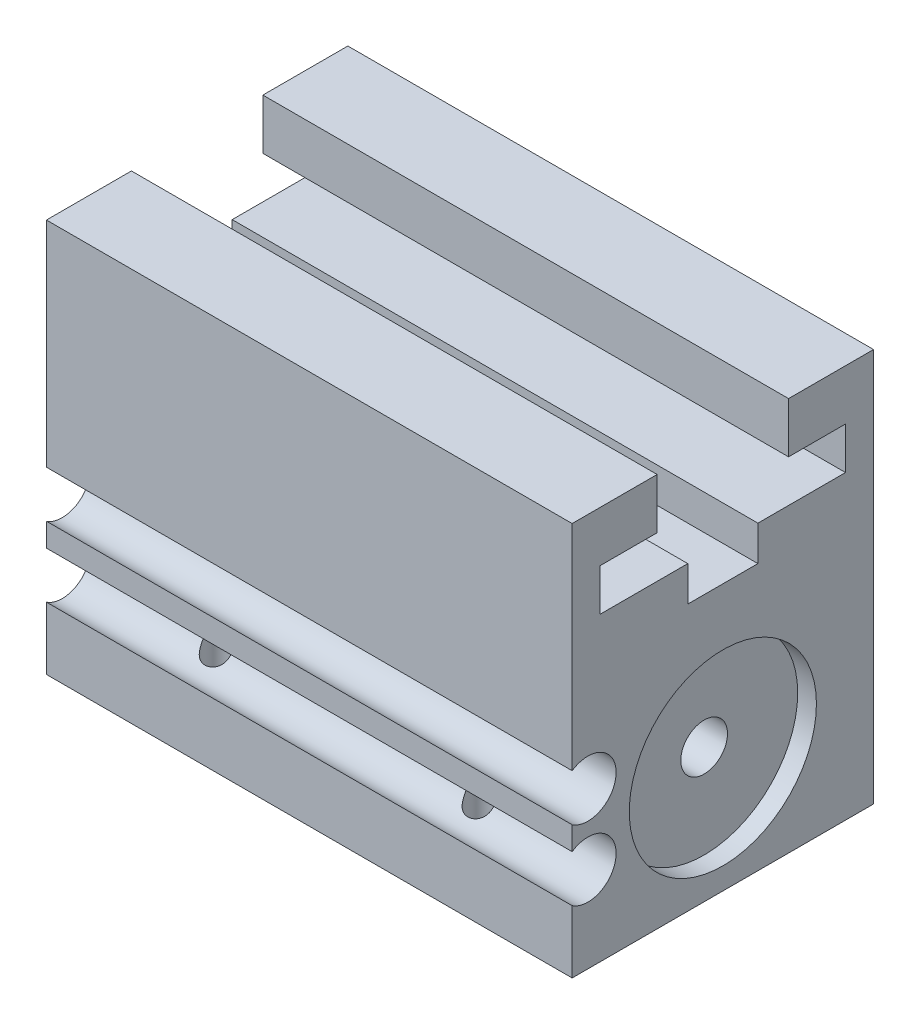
ISO-10303-21;
HEADER;
FILE_DESCRIPTION(('STEP AP214'),'2;1');
FILE_NAME('part.step','',(''),(''),'','','');
FILE_SCHEMA(('AUTOMOTIVE_DESIGN { 1 0 10303 214 1 1 1 1 }'));
ENDSEC;
DATA;
#1=APPLICATION_CONTEXT('core data for automotive mechanical design processes');
#2=APPLICATION_PROTOCOL_DEFINITION('international standard','automotive_design',2000,#1);
#3=PRODUCT_CONTEXT('',#1,'mechanical');
#4=PRODUCT('Part','Part','',(#3));
#5=PRODUCT_RELATED_PRODUCT_CATEGORY('part','',(#4));
#6=PRODUCT_DEFINITION_FORMATION('','',#4);
#7=PRODUCT_DEFINITION_CONTEXT('part definition',#1,'design');
#8=PRODUCT_DEFINITION('design','',#6,#7);
#9=PRODUCT_DEFINITION_SHAPE('','',#8);
#10=(LENGTH_UNIT() NAMED_UNIT(*) SI_UNIT(.MILLI.,.METRE.));
#11=(NAMED_UNIT(*) PLANE_ANGLE_UNIT() SI_UNIT($,.RADIAN.));
#12=(NAMED_UNIT(*) SI_UNIT($,.STERADIAN.) SOLID_ANGLE_UNIT());
#13=UNCERTAINTY_MEASURE_WITH_UNIT(LENGTH_MEASURE(1.E-05),#10,'distance_accuracy_value','');
#14=(GEOMETRIC_REPRESENTATION_CONTEXT(3) GLOBAL_UNCERTAINTY_ASSIGNED_CONTEXT((#13)) GLOBAL_UNIT_ASSIGNED_CONTEXT((#10,
#11,#12)) REPRESENTATION_CONTEXT('',''));
#15=CARTESIAN_POINT('',(0.,0.,0.));
#16=DIRECTION('',(0.,0.,1.));
#17=DIRECTION('',(1.,0.,0.));
#18=AXIS2_PLACEMENT_3D('',#15,#16,#17);
#19=CARTESIAN_POINT('',(36.74364,-5.9055,0.));
#20=DIRECTION('',(1.,0.,0.));
#21=DIRECTION('',(0.,0.,-1.));
#22=AXIS2_PLACEMENT_3D('',#19,#20,#21);
#23=PLANE('',#22);
#24=CARTESIAN_POINT('',(36.74364,-5.9055,0.));
#25=DIRECTION('',(1.,0.,0.));
#26=DIRECTION('',(0.,0.,-1.));
#27=AXIS2_PLACEMENT_3D('',#24,#25,#26);
#28=CIRCLE('',#27,6.7818);
#29=CARTESIAN_POINT('',(36.74364,-5.9055,-6.7818));
#30=VERTEX_POINT('',#29);
#31=EDGE_CURVE('E271',#30,#30,#28,.T.);
#32=ORIENTED_EDGE('',*,*,#31,.T.);
#33=EDGE_LOOP('',(#32));
#34=FACE_BOUND('',#33,.T.);
#35=CARTESIAN_POINT('',(36.74364,-5.9055,0.));
#36=DIRECTION('',(-1.,0.,0.));
#37=DIRECTION('',(0.,0.,1.));
#38=AXIS2_PLACEMENT_3D('',#35,#36,#37);
#39=CIRCLE('',#38,1.69545);
#40=CARTESIAN_POINT('',(36.74364,-5.9055,1.69545));
#41=VERTEX_POINT('',#40);
#42=EDGE_CURVE('E1202',#41,#41,#39,.T.);
#43=ORIENTED_EDGE('',*,*,#42,.T.);
#44=EDGE_LOOP('',(#43));
#45=FACE_BOUND('',#44,.T.);
#46=ADVANCED_FACE('F33',(#34,#45),#23,.T.);
#47=CARTESIAN_POINT('',(0.,-2.94767,9.77900000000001));
#48=DIRECTION('',(-1.,0.,0.));
#49=DIRECTION('',(0.,0.,1.));
#50=AXIS2_PLACEMENT_3D('',#47,#48,#49);
#51=PLANE('',#50);
#52=CARTESIAN_POINT('',(0.,4.4069,8.7249));
#53=DIRECTION('',(-1.,0.,0.));
#54=DIRECTION('',(0.,0.,1.));
#55=AXIS2_PLACEMENT_3D('',#52,#53,#54);
#56=CIRCLE('',#55,1.397);
#57=CARTESIAN_POINT('',(0.,4.4069,10.1219));
#58=VERTEX_POINT('',#57);
#59=EDGE_CURVE('E255',#58,#58,#56,.T.);
#60=ORIENTED_EDGE('',*,*,#59,.F.);
#61=EDGE_LOOP('',(#60));
#62=FACE_BOUND('',#61,.T.);
#63=CARTESIAN_POINT('',(0.,4.4069,-8.7249));
#64=DIRECTION('',(1.,0.,0.));
#65=DIRECTION('',(0.,0.,-1.));
#66=AXIS2_PLACEMENT_3D('',#63,#64,#65);
#67=CIRCLE('',#66,1.20269);
#68=CARTESIAN_POINT('',(0.,4.4069,-7.52221));
#69=VERTEX_POINT('',#68);
#70=EDGE_CURVE('E262',#69,#69,#67,.T.);
#71=ORIENTED_EDGE('',*,*,#70,.T.);
#72=EDGE_LOOP('',(#71));
#73=FACE_BOUND('',#72,.T.);
#74=DIRECTION('',(0.,-1.,0.));
#75=VECTOR('',#74,1.);
#76=CARTESIAN_POINT('',(0.,-9.7230605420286,10.922));
#77=LINE('',#76,#75);
#78=CARTESIAN_POINT('',(0.,-9.7230605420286,10.922));
#79=VERTEX_POINT('',#78);
#80=CARTESIAN_POINT('',(0.,-14.2621,10.922));
#81=VERTEX_POINT('',#80);
#82=EDGE_CURVE('E274',#79,#81,#77,.T.);
#83=ORIENTED_EDGE('',*,*,#82,.F.);
#84=CARTESIAN_POINT('',(0.,-8.02767,9.77900000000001));
#85=DIRECTION('',(-1.,0.,0.));
#86=DIRECTION('',(0.,0.,1.));
#87=AXIS2_PLACEMENT_3D('',#84,#85,#86);
#88=CIRCLE('',#87,2.0447);
#89=CARTESIAN_POINT('',(0.,-6.3322794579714,10.922));
#90=VERTEX_POINT('',#89);
#91=EDGE_CURVE('E281',#90,#79,#88,.T.);
#92=ORIENTED_EDGE('',*,*,#91,.F.);
#93=DIRECTION('',(0.,-1.,0.));
#94=VECTOR('',#93,1.);
#95=CARTESIAN_POINT('',(0.,-4.6430605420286,10.922));
#96=LINE('',#95,#94);
#97=CARTESIAN_POINT('',(0.,-4.6430605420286,10.922));
#98=VERTEX_POINT('',#97);
#99=EDGE_CURVE('E356',#98,#90,#96,.T.);
#100=ORIENTED_EDGE('',*,*,#99,.F.);
#101=CARTESIAN_POINT('',(0.,-2.94767,9.77900000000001));
#102=DIRECTION('',(-1.,0.,0.));
#103=DIRECTION('',(0.,0.,1.));
#104=AXIS2_PLACEMENT_3D('',#101,#102,#103);
#105=CIRCLE('',#104,2.0447);
#106=CARTESIAN_POINT('',(0.,-1.2522794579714,10.922));
#107=VERTEX_POINT('',#106);
#108=EDGE_CURVE('E354',#107,#98,#105,.T.);
#109=ORIENTED_EDGE('',*,*,#108,.F.);
#110=DIRECTION('',(0.,-1.,0.));
#111=VECTOR('',#110,1.);
#112=CARTESIAN_POINT('',(0.,14.2621,10.922));
#113=LINE('',#112,#111);
#114=CARTESIAN_POINT('',(0.,14.2621,10.922));
#115=VERTEX_POINT('',#114);
#116=EDGE_CURVE('E352',#115,#107,#113,.T.);
#117=ORIENTED_EDGE('',*,*,#116,.F.);
#118=DIRECTION('',(0.,0.,1.));
#119=VECTOR('',#118,1.);
#120=CARTESIAN_POINT('',(0.,14.2621,4.7625));
#121=LINE('',#120,#119);
#122=CARTESIAN_POINT('',(0.,14.2621,4.7625));
#123=VERTEX_POINT('',#122);
#124=EDGE_CURVE('E350',#123,#115,#121,.T.);
#125=ORIENTED_EDGE('',*,*,#124,.F.);
#126=DIRECTION('',(0.,1.,0.));
#127=VECTOR('',#126,1.);
#128=CARTESIAN_POINT('',(0.,10.6045,4.7625));
#129=LINE('',#128,#127);
#130=CARTESIAN_POINT('',(0.,10.6045,4.7625));
#131=VERTEX_POINT('',#130);
#132=EDGE_CURVE('E348',#131,#123,#129,.T.);
#133=ORIENTED_EDGE('',*,*,#132,.F.);
#134=DIRECTION('',(0.,0.,-1.));
#135=VECTOR('',#134,1.);
#136=CARTESIAN_POINT('',(0.,10.6045,8.89));
#137=LINE('',#136,#135);
#138=CARTESIAN_POINT('',(0.,10.6045,8.89));
#139=VERTEX_POINT('',#138);
#140=EDGE_CURVE('E346',#139,#131,#137,.T.);
#141=ORIENTED_EDGE('',*,*,#140,.F.);
#142=DIRECTION('',(0.,1.,0.));
#143=VECTOR('',#142,1.);
#144=CARTESIAN_POINT('',(0.,7.5565,8.89));
#145=LINE('',#144,#143);
#146=CARTESIAN_POINT('',(0.,7.5565,8.89));
#147=VERTEX_POINT('',#146);
#148=EDGE_CURVE('E344',#147,#139,#145,.T.);
#149=ORIENTED_EDGE('',*,*,#148,.F.);
#150=DIRECTION('',(0.,0.,1.));
#151=VECTOR('',#150,1.);
#152=CARTESIAN_POINT('',(0.,7.5565,2.54));
#153=LINE('',#152,#151);
#154=CARTESIAN_POINT('',(0.,7.5565,2.54));
#155=VERTEX_POINT('',#154);
#156=EDGE_CURVE('E342',#155,#147,#153,.T.);
#157=ORIENTED_EDGE('',*,*,#156,.F.);
#158=DIRECTION('',(0.,1.,0.));
#159=VECTOR('',#158,1.);
#160=CARTESIAN_POINT('',(0.,5.0165,2.54));
#161=LINE('',#160,#159);
#162=CARTESIAN_POINT('',(0.,5.0165,2.54));
#163=VERTEX_POINT('',#162);
#164=EDGE_CURVE('E340',#163,#155,#161,.T.);
#165=ORIENTED_EDGE('',*,*,#164,.F.);
#166=DIRECTION('',(0.,0.,1.));
#167=VECTOR('',#166,1.);
#168=CARTESIAN_POINT('',(0.,5.0165,-2.54));
#169=LINE('',#168,#167);
#170=CARTESIAN_POINT('',(0.,5.0165,-2.54));
#171=VERTEX_POINT('',#170);
#172=EDGE_CURVE('E338',#171,#163,#169,.T.);
#173=ORIENTED_EDGE('',*,*,#172,.F.);
#174=DIRECTION('',(0.,-1.,0.));
#175=VECTOR('',#174,1.);
#176=CARTESIAN_POINT('',(0.,7.5565,-2.54));
#177=LINE('',#176,#175);
#178=CARTESIAN_POINT('',(0.,7.5565,-2.54));
#179=VERTEX_POINT('',#178);
#180=EDGE_CURVE('E336',#179,#171,#177,.T.);
#181=ORIENTED_EDGE('',*,*,#180,.F.);
#182=DIRECTION('',(0.,0.,1.));
#183=VECTOR('',#182,1.);
#184=CARTESIAN_POINT('',(0.,7.5565,-8.89));
#185=LINE('',#184,#183);
#186=CARTESIAN_POINT('',(0.,7.5565,-8.89));
#187=VERTEX_POINT('',#186);
#188=EDGE_CURVE('E334',#187,#179,#185,.T.);
#189=ORIENTED_EDGE('',*,*,#188,.F.);
#190=DIRECTION('',(0.,-1.,0.));
#191=VECTOR('',#190,1.);
#192=CARTESIAN_POINT('',(0.,10.6045,-8.89));
#193=LINE('',#192,#191);
#194=CARTESIAN_POINT('',(0.,10.6045,-8.89));
#195=VERTEX_POINT('',#194);
#196=EDGE_CURVE('E332',#195,#187,#193,.T.);
#197=ORIENTED_EDGE('',*,*,#196,.F.);
#198=DIRECTION('',(0.,0.,-1.));
#199=VECTOR('',#198,1.);
#200=CARTESIAN_POINT('',(0.,10.6045,-4.7625));
#201=LINE('',#200,#199);
#202=CARTESIAN_POINT('',(0.,10.6045,-4.7625));
#203=VERTEX_POINT('',#202);
#204=EDGE_CURVE('E330',#203,#195,#201,.T.);
#205=ORIENTED_EDGE('',*,*,#204,.F.);
#206=DIRECTION('',(0.,-1.,0.));
#207=VECTOR('',#206,1.);
#208=CARTESIAN_POINT('',(0.,14.2621,-4.7625));
#209=LINE('',#208,#207);
#210=CARTESIAN_POINT('',(0.,14.2621,-4.7625));
#211=VERTEX_POINT('',#210);
#212=EDGE_CURVE('E328',#211,#203,#209,.T.);
#213=ORIENTED_EDGE('',*,*,#212,.F.);
#214=DIRECTION('',(0.,0.,1.));
#215=VECTOR('',#214,1.);
#216=CARTESIAN_POINT('',(0.,14.2621,-10.922));
#217=LINE('',#216,#215);
#218=CARTESIAN_POINT('',(0.,14.2621,-10.922));
#219=VERTEX_POINT('',#218);
#220=EDGE_CURVE('E326',#219,#211,#217,.T.);
#221=ORIENTED_EDGE('',*,*,#220,.F.);
#222=DIRECTION('',(0.,1.,0.));
#223=VECTOR('',#222,1.);
#224=CARTESIAN_POINT('',(0.,-14.2621,-10.922));
#225=LINE('',#224,#223);
#226=CARTESIAN_POINT('',(0.,-14.2621,-10.922));
#227=VERTEX_POINT('',#226);
#228=EDGE_CURVE('E324',#227,#219,#225,.T.);
#229=ORIENTED_EDGE('',*,*,#228,.F.);
#230=DIRECTION('',(0.,0.,-1.));
#231=VECTOR('',#230,1.);
#232=CARTESIAN_POINT('',(0.,-14.2621,10.922));
#233=LINE('',#232,#231);
#234=EDGE_CURVE('E322',#81,#227,#233,.T.);
#235=ORIENTED_EDGE('',*,*,#234,.F.);
#236=EDGE_LOOP('',(#83,#92,#100,#109,#117,#125,#133,#141,#149,#157,#165,#173,#181,#189,#197,
#205,#213,#221,#229,#235));
#237=FACE_BOUND('',#236,.T.);
#238=CARTESIAN_POINT('',(0.,-11.4681,8.7249));
#239=DIRECTION('',(1.,0.,0.));
#240=DIRECTION('',(0.,0.,-1.));
#241=AXIS2_PLACEMENT_3D('',#238,#239,#240);
#242=CIRCLE('',#241,1.20269);
#243=CARTESIAN_POINT('',(0.,-11.4681,9.92759));
#244=VERTEX_POINT('',#243);
#245=EDGE_CURVE('E258',#244,#244,#242,.T.);
#246=ORIENTED_EDGE('',*,*,#245,.T.);
#247=EDGE_LOOP('',(#246));
#248=FACE_BOUND('',#247,.T.);
#249=CARTESIAN_POINT('',(0.,-11.4681,-8.7249));
#250=DIRECTION('',(-1.,0.,0.));
#251=DIRECTION('',(0.,0.,1.));
#252=AXIS2_PLACEMENT_3D('',#249,#250,#251);
#253=CIRCLE('',#252,1.397);
#254=CARTESIAN_POINT('',(0.,-11.4681,-7.3279));
#255=VERTEX_POINT('',#254);
#256=EDGE_CURVE('E246',#255,#255,#253,.T.);
#257=ORIENTED_EDGE('',*,*,#256,.F.);
#258=EDGE_LOOP('',(#257));
#259=FACE_BOUND('',#258,.T.);
#260=CARTESIAN_POINT('',(0.,-5.9055,0.));
#261=DIRECTION('',(1.,0.,0.));
#262=DIRECTION('',(0.,0.,-1.));
#263=AXIS2_PLACEMENT_3D('',#260,#261,#262);
#264=CIRCLE('',#263,6.7818);
#265=CARTESIAN_POINT('',(0.,0.856048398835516,0.523712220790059));
#266=VERTEX_POINT('',#265);
#267=CARTESIAN_POINT('',(0.,0.856048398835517,-0.523712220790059));
#268=VERTEX_POINT('',#267);
#269=EDGE_CURVE('E208',#266,#268,#264,.T.);
#270=ORIENTED_EDGE('',*,*,#269,.T.);
#271=CARTESIAN_POINT('',(0.,2.8194,0.));
#272=DIRECTION('',(-1.,0.,0.));
#273=DIRECTION('',(0.,0.,1.));
#274=AXIS2_PLACEMENT_3D('',#271,#272,#273);
#275=CIRCLE('',#274,2.032);
#276=EDGE_CURVE('E52',#266,#268,#275,.T.);
#277=ORIENTED_EDGE('',*,*,#276,.F.);
#278=EDGE_LOOP('',(#270,#277));
#279=FACE_BOUND('',#278,.T.);
#280=ADVANCED_FACE('F207',(#62,#73,#237,#248,#259,#279),#51,.T.);
#281=CARTESIAN_POINT('',(1.35636,-5.9055,0.));
#282=DIRECTION('',(-1.,0.,0.));
#283=DIRECTION('',(0.,0.,1.));
#284=AXIS2_PLACEMENT_3D('',#281,#282,#283);
#285=CYLINDRICAL_SURFACE('',#284,6.7818);
#286=CARTESIAN_POINT('',(1.35636,-5.9055,0.));
#287=DIRECTION('',(1.,0.,0.));
#288=DIRECTION('',(0.,0.,-1.));
#289=AXIS2_PLACEMENT_3D('',#286,#287,#288);
#290=CIRCLE('',#289,6.7818);
#291=CARTESIAN_POINT('',(1.35636,-5.9055,-6.7818));
#292=VERTEX_POINT('',#291);
#293=EDGE_CURVE('E213',#292,#292,#290,.T.);
#294=ORIENTED_EDGE('',*,*,#293,.T.);
#295=EDGE_LOOP('',(#294));
#296=FACE_BOUND('',#295,.T.);
#297=ORIENTED_EDGE('',*,*,#269,.F.);
#298=CARTESIAN_POINT('',(-0.000200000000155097,0.856001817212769,0.524313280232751));
#299=CARTESIAN_POINT('',(0.0160462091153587,0.859784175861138,0.475592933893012));
#300=CARTESIAN_POINT('',(0.0304015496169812,0.863083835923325,0.426153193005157));
#301=CARTESIAN_POINT('',(0.0547683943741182,0.868640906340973,0.326077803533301));
#302=CARTESIAN_POINT('',(0.0647726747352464,0.870896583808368,0.27544031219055));
#303=CARTESIAN_POINT('',(0.0795718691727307,0.874220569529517,0.175043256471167));
#304=CARTESIAN_POINT('',(0.084526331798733,0.875325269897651,0.125309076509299));
#305=CARTESIAN_POINT('',(0.0895037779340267,0.876434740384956,0.0256407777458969));
#306=CARTESIAN_POINT('',(0.0895317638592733,0.876440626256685,-0.0242930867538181));
#307=CARTESIAN_POINT('',(0.0833617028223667,0.875066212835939,-0.149793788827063));
#308=CARTESIAN_POINT('',(0.0739260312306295,0.872965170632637,-0.22521903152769));
#309=CARTESIAN_POINT('',(0.0519628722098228,0.867998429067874,-0.337640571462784));
#310=CARTESIAN_POINT('',(0.0431748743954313,0.86600248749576,-0.375474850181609));
#311=CARTESIAN_POINT('',(0.0232094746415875,0.861428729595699,-0.450433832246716));
#312=CARTESIAN_POINT('',(0.012034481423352,0.858851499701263,-0.487559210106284));
#313=CARTESIAN_POINT('',(-0.000200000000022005,0.8560018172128,-0.524313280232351));
#314=B_SPLINE_CURVE_WITH_KNOTS('',3,(#298,#299,#300,#301,#302,#303,#304,#305,#306,#307,#308,
#309,#310,#311,#312,#313),.UNSPECIFIED.,.F.,.F.,(4,2,2,2,2,2,2,4),(0.,0.154522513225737,
0.309300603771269,0.459020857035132,0.608589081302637,0.835753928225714,0.952364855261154,
1.06885866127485),.UNSPECIFIED.);
#315=EDGE_CURVE('E11',#266,#268,#314,.T.);
#316=ORIENTED_EDGE('',*,*,#315,.T.);
#317=EDGE_LOOP('',(#297,#316));
#318=FACE_BOUND('',#317,.T.);
#319=ADVANCED_FACE('F212',(#296,#318),#285,.F.);
#320=CARTESIAN_POINT('',(38.1,-14.2621,10.922));
#321=DIRECTION('',(0.,1.,0.));
#322=DIRECTION('',(0.,0.,1.));
#323=AXIS2_PLACEMENT_3D('',#320,#321,#322);
#324=PLANE('',#323);
#325=CARTESIAN_POINT('',(15.875,-14.2621,7.9375));
#326=DIRECTION('',(0.,1.,0.));
#327=DIRECTION('',(0.,0.,1.));
#328=AXIS2_PLACEMENT_3D('',#325,#326,#327);
#329=CIRCLE('',#328,1.20269);
#330=CARTESIAN_POINT('',(15.875,-14.2621,9.14019));
#331=VERTEX_POINT('',#330);
#332=EDGE_CURVE('E667',#331,#331,#329,.T.);
#333=ORIENTED_EDGE('',*,*,#332,.T.);
#334=EDGE_LOOP('',(#333));
#335=FACE_BOUND('',#334,.T.);
#336=CARTESIAN_POINT('',(28.575,-14.2621,-7.9375));
#337=DIRECTION('',(0.,-1.,0.));
#338=DIRECTION('',(0.,0.,-1.));
#339=AXIS2_PLACEMENT_3D('',#336,#337,#338);
#340=CIRCLE('',#339,1.397);
#341=CARTESIAN_POINT('',(28.575,-14.2621,-9.3345));
#342=VERTEX_POINT('',#341);
#343=EDGE_CURVE('E688',#342,#342,#340,.T.);
#344=ORIENTED_EDGE('',*,*,#343,.F.);
#345=EDGE_LOOP('',(#344));
#346=FACE_BOUND('',#345,.T.);
#347=CARTESIAN_POINT('',(9.525,-14.2621,7.9375));
#348=DIRECTION('',(0.,-1.,0.));
#349=DIRECTION('',(0.,0.,-1.));
#350=AXIS2_PLACEMENT_3D('',#347,#348,#349);
#351=CIRCLE('',#350,1.397);
#352=CARTESIAN_POINT('',(9.525,-14.2621,6.5405));
#353=VERTEX_POINT('',#352);
#354=EDGE_CURVE('E214',#353,#353,#351,.T.);
#355=ORIENTED_EDGE('',*,*,#354,.F.);
#356=EDGE_LOOP('',(#355));
#357=FACE_BOUND('',#356,.T.);
#358=ORIENTED_EDGE('',*,*,#234,.T.);
#359=DIRECTION('',(-1.,0.,0.));
#360=VECTOR('',#359,1.);
#361=CARTESIAN_POINT('',(38.1,-14.2621,-10.922));
#362=LINE('',#361,#360);
#363=CARTESIAN_POINT('',(38.1,-14.2621,-10.922));
#364=VERTEX_POINT('',#363);
#365=EDGE_CURVE('E412',#364,#227,#362,.T.);
#366=ORIENTED_EDGE('',*,*,#365,.F.);
#367=DIRECTION('',(0.,0.,-1.));
#368=VECTOR('',#367,1.);
#369=CARTESIAN_POINT('',(38.1,-14.2621,10.922));
#370=LINE('',#369,#368);
#371=CARTESIAN_POINT('',(38.1,-14.2621,10.922));
#372=VERTEX_POINT('',#371);
#373=EDGE_CURVE('E280',#372,#364,#370,.T.);
#374=ORIENTED_EDGE('',*,*,#373,.F.);
#375=DIRECTION('',(-1.,0.,0.));
#376=VECTOR('',#375,1.);
#377=CARTESIAN_POINT('',(38.1,-14.2621,10.922));
#378=LINE('',#377,#376);
#379=EDGE_CURVE('E415',#372,#81,#378,.T.);
#380=ORIENTED_EDGE('',*,*,#379,.T.);
#381=EDGE_LOOP('',(#358,#366,#374,#380));
#382=FACE_BOUND('',#381,.T.);
#383=CARTESIAN_POINT('',(28.575,-14.2621,7.9375));
#384=DIRECTION('',(0.,-1.,0.));
#385=DIRECTION('',(0.,0.,-1.));
#386=AXIS2_PLACEMENT_3D('',#383,#384,#385);
#387=CIRCLE('',#386,1.397);
#388=CARTESIAN_POINT('',(28.575,-14.2621,6.5405));
#389=VERTEX_POINT('',#388);
#390=EDGE_CURVE('E656',#389,#389,#387,.T.);
#391=ORIENTED_EDGE('',*,*,#390,.F.);
#392=EDGE_LOOP('',(#391));
#393=FACE_BOUND('',#392,.T.);
#394=CARTESIAN_POINT('',(9.525,-14.2621,-7.9375));
#395=DIRECTION('',(0.,-1.,0.));
#396=DIRECTION('',(0.,0.,-1.));
#397=AXIS2_PLACEMENT_3D('',#394,#395,#396);
#398=CIRCLE('',#397,1.397);
#399=CARTESIAN_POINT('',(9.525,-14.2621,-9.3345));
#400=VERTEX_POINT('',#399);
#401=EDGE_CURVE('E660',#400,#400,#398,.T.);
#402=ORIENTED_EDGE('',*,*,#401,.F.);
#403=EDGE_LOOP('',(#402));
#404=FACE_BOUND('',#403,.T.);
#405=CARTESIAN_POINT('',(22.225,-14.2621,-7.9375));
#406=DIRECTION('',(0.,1.,0.));
#407=DIRECTION('',(0.,0.,1.));
#408=AXIS2_PLACEMENT_3D('',#405,#406,#407);
#409=CIRCLE('',#408,1.20269);
#410=CARTESIAN_POINT('',(22.225,-14.2621,-6.73481));
#411=VERTEX_POINT('',#410);
#412=EDGE_CURVE('E209',#411,#411,#409,.T.);
#413=ORIENTED_EDGE('',*,*,#412,.T.);
#414=EDGE_LOOP('',(#413));
#415=FACE_BOUND('',#414,.T.);
#416=ADVANCED_FACE('F459',(#335,#346,#357,#382,#393,#404,#415),#324,.F.);
#417=CARTESIAN_POINT('',(38.1,-8.02767,9.77900000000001));
#418=DIRECTION('',(-1.,0.,0.));
#419=DIRECTION('',(0.,0.,1.));
#420=AXIS2_PLACEMENT_3D('',#417,#418,#419);
#421=CYLINDRICAL_SURFACE('',#420,2.0447);
#422=CARTESIAN_POINT('',(8.50901420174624,-8.9050878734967,7.9321280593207));
#423=CARTESIAN_POINT('',(8.50892476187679,-8.94366474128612,7.95045035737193));
#424=CARTESIAN_POINT('',(8.50931028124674,-8.98167642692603,7.96999536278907));
#425=CARTESIAN_POINT('',(8.51147906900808,-9.05643097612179,8.01143843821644));
#426=CARTESIAN_POINT('',(8.51326459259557,-9.09317169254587,8.0333402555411));
#427=CARTESIAN_POINT('',(8.51870893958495,-9.16544584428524,8.07955298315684));
#428=CARTESIAN_POINT('',(8.52238458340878,-9.20096533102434,8.10388391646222));
#429=CARTESIAN_POINT('',(8.53211940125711,-9.27016430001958,8.15454750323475));
#430=CARTESIAN_POINT('',(8.53817689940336,-9.30384505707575,8.18087873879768));
#431=CARTESIAN_POINT('',(8.55705907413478,-9.38585684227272,8.24921579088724));
#432=CARTESIAN_POINT('',(8.57176056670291,-9.43286109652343,8.29234526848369));
#433=CARTESIAN_POINT('',(8.60953776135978,-9.52085722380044,8.38076382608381));
#434=CARTESIAN_POINT('',(8.63258356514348,-9.56186983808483,8.42604470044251));
#435=CARTESIAN_POINT('',(8.68869292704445,-9.63747399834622,8.51691561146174));
#436=CARTESIAN_POINT('',(8.72186390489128,-9.67198994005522,8.5625035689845));
#437=CARTESIAN_POINT('',(8.79851519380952,-9.73334771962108,8.65013760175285));
#438=CARTESIAN_POINT('',(8.84199407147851,-9.76019062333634,8.69218416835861));
#439=CARTESIAN_POINT('',(8.93110508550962,-9.80279649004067,8.76352093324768));
#440=CARTESIAN_POINT('',(8.97546734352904,-9.81961107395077,8.79377806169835));
#441=CARTESIAN_POINT('',(9.06968952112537,-9.84805633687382,8.8473799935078));
#442=CARTESIAN_POINT('',(9.11954776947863,-9.85968858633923,8.87072689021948));
#443=CARTESIAN_POINT('',(9.21958040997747,-9.8776258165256,8.90787469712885));
#444=CARTESIAN_POINT('',(9.26949825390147,-9.88424162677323,8.92222079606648));
#445=CARTESIAN_POINT('',(9.37127575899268,-9.89375650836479,8.94314552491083));
#446=CARTESIAN_POINT('',(9.42313522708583,-9.89665594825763,8.94972492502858));
#447=CARTESIAN_POINT('',(9.52728627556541,-9.89891451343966,8.9548336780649));
#448=CARTESIAN_POINT('',(9.57957751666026,-9.89827619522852,8.95336884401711));
#449=CARTESIAN_POINT('',(9.68315517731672,-9.89342507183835,8.94246484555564));
#450=CARTESIAN_POINT('',(9.73444158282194,-9.88921221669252,8.93302556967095));
#451=CARTESIAN_POINT('',(9.83463680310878,-9.87695400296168,8.90655622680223));
#452=CARTESIAN_POINT('',(9.88354134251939,-9.86890201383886,8.88951303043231));
#453=CARTESIAN_POINT('',(9.97746809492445,-9.84858203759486,8.84862617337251));
#454=CARTESIAN_POINT('',(10.022491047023,-9.83631485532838,8.82478381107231));
#455=CARTESIAN_POINT('',(10.1072454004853,-9.8072405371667,8.77160901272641));
#456=CARTESIAN_POINT('',(10.146999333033,-9.79045372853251,8.74230133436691));
#457=CARTESIAN_POINT('',(10.220552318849,-9.75208006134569,8.67965750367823));
#458=CARTESIAN_POINT('',(10.254351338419,-9.73049317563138,8.64632132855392));
#459=CARTESIAN_POINT('',(10.3162242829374,-9.6820139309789,8.57659366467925));
#460=CARTESIAN_POINT('',(10.344158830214,-9.65501707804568,8.54015174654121));
#461=CARTESIAN_POINT('',(10.3934586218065,-9.59634719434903,8.4666482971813));
#462=CARTESIAN_POINT('',(10.414823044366,-9.5646735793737,8.4295866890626));
#463=CARTESIAN_POINT('',(10.4585531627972,-9.48426183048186,8.34238987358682));
#464=CARTESIAN_POINT('',(10.4782025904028,-9.43361825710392,8.29265002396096));
#465=CARTESIAN_POINT('',(10.5084335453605,-9.32574902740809,8.19754472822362));
#466=CARTESIAN_POINT('',(10.5189818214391,-9.26850009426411,8.15219585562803));
#467=CARTESIAN_POINT('',(10.5321088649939,-9.16079169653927,8.07597652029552));
#468=CARTESIAN_POINT('',(10.5358498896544,-9.11122324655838,8.04401521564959));
#469=CARTESIAN_POINT('',(10.5403308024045,-9.00980284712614,7.98466002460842));
#470=CARTESIAN_POINT('',(10.5410938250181,-8.95797167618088,7.95723252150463));
#471=CARTESIAN_POINT('',(10.5409857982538,-8.9050878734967,7.9321280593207));
#472=B_SPLINE_CURVE_WITH_KNOTS('',3,(#422,#423,#424,#425,#426,#427,#428,#429,#430,#431,#432,
#433,#434,#435,#436,#437,#438,#439,#440,#441,#442,#443,#444,#445,#446,#447,#448,#449,#450,#451,
#452,#453,#454,#455,#456,#457,#458,#459,#460,#461,#462,#463,#464,#465,#466,#467,#468,#469,#470,
#471),.UNSPECIFIED.,.F.,.F.,(4,2,2,2,2,2,2,2,2,2,2,2,2,2,2,2,2,2,2,2,2,2,2,2,4),(0.,
0.128116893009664,0.256440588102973,0.385926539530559,0.515321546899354,0.71095704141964,
0.905898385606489,1.10298435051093,1.30004292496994,1.46795211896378,1.63581039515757,
1.79214820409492,1.94847050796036,2.1046798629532,2.26089140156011,2.4173737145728,
2.57382616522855,2.72958638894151,2.88534749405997,3.04447187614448,3.20361615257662,
3.4233576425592,3.64389860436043,3.82089850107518,3.99652060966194),.UNSPECIFIED.);
#473=CARTESIAN_POINT('',(8.50901420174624,-8.9050878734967,7.9321280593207));
#474=VERTEX_POINT('',#473);
#475=CARTESIAN_POINT('',(10.5409857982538,-8.90508787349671,7.9321280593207));
#476=VERTEX_POINT('',#475);
#477=EDGE_CURVE('E425',#474,#476,#472,.T.);
#478=ORIENTED_EDGE('',*,*,#477,.F.);
#479=CARTESIAN_POINT('',(10.6426939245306,-8.96394666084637,7.96125851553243));
#480=CARTESIAN_POINT('',(10.5925362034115,-8.93482036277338,7.94625721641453));
#481=CARTESIAN_POINT('',(10.5421211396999,-8.90568866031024,7.93213690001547));
#482=CARTESIAN_POINT('',(10.4408016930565,-8.84749246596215,7.90557710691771));
#483=CARTESIAN_POINT('',(10.3898972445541,-8.81842798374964,7.89313785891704));
#484=CARTESIAN_POINT('',(10.2880172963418,-8.76066722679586,7.86994943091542));
#485=CARTESIAN_POINT('',(10.237045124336,-8.73196981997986,7.85918839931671));
#486=CARTESIAN_POINT('',(10.1346352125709,-8.67488524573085,7.83920030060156));
#487=CARTESIAN_POINT('',(10.0831975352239,-8.64649803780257,7.82997303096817));
#488=CARTESIAN_POINT('',(10.0073090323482,-8.60539331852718,7.81756662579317));
#489=CARTESIAN_POINT('',(9.98310557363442,-8.59239803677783,7.81378771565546));
#490=CARTESIAN_POINT('',(9.9345130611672,-8.56665059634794,7.80657090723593));
#491=CARTESIAN_POINT('',(9.91012397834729,-8.55389847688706,7.80313306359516));
#492=CARTESIAN_POINT('',(9.86094648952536,-8.5287157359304,7.79659710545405));
#493=CARTESIAN_POINT('',(9.83615656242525,-8.51628751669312,7.79350116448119));
#494=CARTESIAN_POINT('',(9.78618659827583,-8.49214461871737,7.78771524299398));
#495=CARTESIAN_POINT('',(9.76100670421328,-8.48042968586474,7.78502511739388));
#496=CARTESIAN_POINT('',(9.71083227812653,-8.45872596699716,7.7802236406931));
#497=CARTESIAN_POINT('',(9.68585830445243,-8.44869346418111,7.77809632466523));
#498=CARTESIAN_POINT('',(9.6350642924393,-8.43142314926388,7.77454028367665));
#499=CARTESIAN_POINT('',(9.60925527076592,-8.42415828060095,7.77310475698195));
#500=CARTESIAN_POINT('',(9.57292935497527,-8.41789227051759,7.77188065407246));
#501=CARTESIAN_POINT('',(9.56284673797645,-8.41655998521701,7.77162274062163));
#502=CARTESIAN_POINT('',(9.54260206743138,-8.41482629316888,7.77128765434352));
#503=CARTESIAN_POINT('',(9.53244006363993,-8.41442434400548,7.77121037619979));
#504=CARTESIAN_POINT('',(9.51209317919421,-8.41459709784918,7.77124366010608));
#505=CARTESIAN_POINT('',(9.50190832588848,-8.41517484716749,7.77135480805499));
#506=CARTESIAN_POINT('',(9.48163626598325,-8.41724526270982,7.77175554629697));
#507=CARTESIAN_POINT('',(9.47154908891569,-8.41873819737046,7.77204518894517));
#508=CARTESIAN_POINT('',(9.44004332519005,-8.42463908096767,7.77320090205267));
#509=CARTESIAN_POINT('',(9.4188997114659,-8.43042637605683,7.77434706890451));
#510=CARTESIAN_POINT('',(9.37728630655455,-8.44398709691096,7.7771193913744));
#511=CARTESIAN_POINT('',(9.35681874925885,-8.45176648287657,7.77874698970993));
#512=CARTESIAN_POINT('',(9.3159201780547,-8.46857103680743,7.78238277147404));
#513=CARTESIAN_POINT('',(9.29549956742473,-8.47761954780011,7.78439843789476));
#514=CARTESIAN_POINT('',(9.25501950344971,-8.49633639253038,7.78871296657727));
#515=CARTESIAN_POINT('',(9.23495954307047,-8.50600375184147,7.79101138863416));
#516=CARTESIAN_POINT('',(9.17816821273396,-8.53405210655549,7.79790818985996));
#517=CARTESIAN_POINT('',(9.14169645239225,-8.55288292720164,7.8028067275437));
#518=CARTESIAN_POINT('',(9.0691639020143,-8.59111723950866,7.81336483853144));
#519=CARTESIAN_POINT('',(9.03310318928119,-8.61052083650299,7.81902455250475));
#520=CARTESIAN_POINT('',(8.92527148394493,-8.66921899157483,7.83712286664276));
#521=CARTESIAN_POINT('',(8.8539270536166,-8.70896136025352,7.8506711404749));
#522=CARTESIAN_POINT('',(8.71963242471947,-8.78456996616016,7.87916783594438));
#523=CARTESIAN_POINT('',(8.65659654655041,-8.82039885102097,7.89381404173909));
#524=CARTESIAN_POINT('',(8.53134883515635,-8.89213748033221,7.92561768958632));
#525=CARTESIAN_POINT('',(8.46913584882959,-8.92804700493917,7.9427710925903));
#526=CARTESIAN_POINT('',(8.4073060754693,-8.96394666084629,7.96125851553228));
#527=B_SPLINE_CURVE_WITH_KNOTS('',3,(#479,#480,#481,#482,#483,#484,#485,#486,#487,#488,#489,
#490,#491,#492,#493,#494,#495,#496,#497,#498,#499,#500,#501,#502,#503,#504,#505,#506,#507,#508,
#509,#510,#511,#512,#513,#514,#515,#516,#517,#518,#519,#520,#521,#522,#523,#524,#525,#526),
.UNSPECIFIED.,.F.,.F.,(4,2,2,2,2,2,2,2,2,2,2,2,2,2,2,2,2,2,2,2,2,2,2,4),(0.,0.179718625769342,
0.35946167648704,0.537871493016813,0.716257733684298,0.799445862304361,0.882647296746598,
0.966350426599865,1.05002355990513,1.13097810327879,1.21111957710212,1.24160016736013,
1.27206298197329,1.30262069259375,1.33318737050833,1.39881744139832,1.46464621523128,
1.53190150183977,1.59905337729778,1.72304056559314,1.84705069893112,2.09532971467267,
2.31719992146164,2.53871656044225),.UNSPECIFIED.);
#528=EDGE_CURVE('E418',#476,#474,#527,.T.);
#529=ORIENTED_EDGE('',*,*,#528,.F.);
#530=EDGE_LOOP('',(#478,#529));
#531=FACE_BOUND('',#530,.T.);
#532=ORIENTED_EDGE('',*,*,#91,.T.);
#533=DIRECTION('',(-1.,0.,0.));
#534=VECTOR('',#533,1.);
#535=CARTESIAN_POINT('',(38.1,-9.7230605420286,10.922));
#536=LINE('',#535,#534);
#537=CARTESIAN_POINT('',(38.1,-9.7230605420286,10.922));
#538=VERTEX_POINT('',#537);
#539=EDGE_CURVE('E319',#538,#79,#536,.T.);
#540=ORIENTED_EDGE('',*,*,#539,.F.);
#541=CARTESIAN_POINT('',(38.1,-8.02767,9.77900000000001));
#542=DIRECTION('',(-1.,0.,0.));
#543=DIRECTION('',(0.,0.,1.));
#544=AXIS2_PLACEMENT_3D('',#541,#542,#543);
#545=CIRCLE('',#544,2.0447);
#546=CARTESIAN_POINT('',(38.1,-6.3322794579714,10.922));
#547=VERTEX_POINT('',#546);
#548=EDGE_CURVE('E317',#547,#538,#545,.T.);
#549=ORIENTED_EDGE('',*,*,#548,.F.);
#550=DIRECTION('',(-1.,0.,0.));
#551=VECTOR('',#550,1.);
#552=CARTESIAN_POINT('',(38.1,-6.3322794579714,10.922));
#553=LINE('',#552,#551);
#554=EDGE_CURVE('E361',#547,#90,#553,.T.);
#555=ORIENTED_EDGE('',*,*,#554,.T.);
#556=EDGE_LOOP('',(#532,#540,#549,#555));
#557=FACE_BOUND('',#556,.T.);
#558=CARTESIAN_POINT('',(27.5590142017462,-8.9050878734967,7.9321280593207));
#559=CARTESIAN_POINT('',(27.5589247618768,-8.94366474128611,7.95045035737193));
#560=CARTESIAN_POINT('',(27.5593102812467,-8.98167642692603,7.96999536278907));
#561=CARTESIAN_POINT('',(27.5614790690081,-9.05643097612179,8.01143843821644));
#562=CARTESIAN_POINT('',(27.5632645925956,-9.09317169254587,8.0333402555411));
#563=CARTESIAN_POINT('',(27.5687089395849,-9.16544584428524,8.07955298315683));
#564=CARTESIAN_POINT('',(27.5723845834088,-9.20096533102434,8.10388391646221));
#565=CARTESIAN_POINT('',(27.5821194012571,-9.27016430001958,8.15454750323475));
#566=CARTESIAN_POINT('',(27.5881768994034,-9.30384505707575,8.18087873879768));
#567=CARTESIAN_POINT('',(27.6070590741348,-9.38585684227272,8.24921579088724));
#568=CARTESIAN_POINT('',(27.6217605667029,-9.43286109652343,8.29234526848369));
#569=CARTESIAN_POINT('',(27.6595377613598,-9.52085722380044,8.38076382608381));
#570=CARTESIAN_POINT('',(27.6825835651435,-9.56186983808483,8.42604470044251));
#571=CARTESIAN_POINT('',(27.7386929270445,-9.63747399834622,8.51691561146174));
#572=CARTESIAN_POINT('',(27.7718639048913,-9.67198994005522,8.5625035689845));
#573=CARTESIAN_POINT('',(27.8485151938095,-9.73334771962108,8.65013760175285));
#574=CARTESIAN_POINT('',(27.8919940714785,-9.76019062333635,8.69218416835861));
#575=CARTESIAN_POINT('',(27.9811050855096,-9.80279649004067,8.76352093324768));
#576=CARTESIAN_POINT('',(28.025467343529,-9.81961107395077,8.79377806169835));
#577=CARTESIAN_POINT('',(28.1196895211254,-9.84805633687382,8.8473799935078));
#578=CARTESIAN_POINT('',(28.1695477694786,-9.85968858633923,8.87072689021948));
#579=CARTESIAN_POINT('',(28.2695804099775,-9.8776258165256,8.90787469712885));
#580=CARTESIAN_POINT('',(28.3194982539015,-9.88424162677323,8.92222079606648));
#581=CARTESIAN_POINT('',(28.4212757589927,-9.89375650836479,8.94314552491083));
#582=CARTESIAN_POINT('',(28.4731352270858,-9.89665594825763,8.94972492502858));
#583=CARTESIAN_POINT('',(28.5772862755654,-9.89891451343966,8.9548336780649));
#584=CARTESIAN_POINT('',(28.6295775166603,-9.89827619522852,8.95336884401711));
#585=CARTESIAN_POINT('',(28.7331551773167,-9.89342507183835,8.94246484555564));
#586=CARTESIAN_POINT('',(28.7844415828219,-9.88921221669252,8.93302556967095));
#587=CARTESIAN_POINT('',(28.8846368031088,-9.87695400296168,8.90655622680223));
#588=CARTESIAN_POINT('',(28.9335413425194,-9.86890201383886,8.88951303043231));
#589=CARTESIAN_POINT('',(29.0274680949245,-9.84858203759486,8.84862617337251));
#590=CARTESIAN_POINT('',(29.072491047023,-9.83631485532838,8.82478381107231));
#591=CARTESIAN_POINT('',(29.1572454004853,-9.8072405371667,8.77160901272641));
#592=CARTESIAN_POINT('',(29.196999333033,-9.79045372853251,8.74230133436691));
#593=CARTESIAN_POINT('',(29.270552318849,-9.75208006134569,8.67965750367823));
#594=CARTESIAN_POINT('',(29.304351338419,-9.73049317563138,8.64632132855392));
#595=CARTESIAN_POINT('',(29.3662242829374,-9.6820139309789,8.57659366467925));
#596=CARTESIAN_POINT('',(29.394158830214,-9.65501707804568,8.54015174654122));
#597=CARTESIAN_POINT('',(29.4434586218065,-9.59634719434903,8.4666482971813));
#598=CARTESIAN_POINT('',(29.464823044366,-9.56467357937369,8.42958668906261));
#599=CARTESIAN_POINT('',(29.5085531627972,-9.48426183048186,8.34238987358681));
#600=CARTESIAN_POINT('',(29.5282025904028,-9.43361825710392,8.29265002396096));
#601=CARTESIAN_POINT('',(29.5584335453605,-9.32574902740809,8.19754472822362));
#602=CARTESIAN_POINT('',(29.5689818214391,-9.26850009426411,8.15219585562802));
#603=CARTESIAN_POINT('',(29.5821088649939,-9.16079169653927,8.07597652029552));
#604=CARTESIAN_POINT('',(29.5858498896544,-9.11122324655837,8.04401521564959));
#605=CARTESIAN_POINT('',(29.5903308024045,-9.00980284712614,7.98466002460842));
#606=CARTESIAN_POINT('',(29.5910938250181,-8.95797167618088,7.95723252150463));
#607=CARTESIAN_POINT('',(29.5909857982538,-8.9050878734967,7.9321280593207));
#608=B_SPLINE_CURVE_WITH_KNOTS('',3,(#558,#559,#560,#561,#562,#563,#564,#565,#566,#567,#568,
#569,#570,#571,#572,#573,#574,#575,#576,#577,#578,#579,#580,#581,#582,#583,#584,#585,#586,#587,
#588,#589,#590,#591,#592,#593,#594,#595,#596,#597,#598,#599,#600,#601,#602,#603,#604,#605,#606,
#607),.UNSPECIFIED.,.F.,.F.,(4,2,2,2,2,2,2,2,2,2,2,2,2,2,2,2,2,2,2,2,2,2,2,2,4),(0.,
0.128116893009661,0.256440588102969,0.385926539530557,0.515321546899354,0.710957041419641,
0.905898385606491,1.10298435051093,1.30004292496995,1.46795211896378,1.63581039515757,
1.79214820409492,1.94847050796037,2.10467986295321,2.26089140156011,2.41737371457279,
2.57382616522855,2.72958638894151,2.88534749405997,3.04447187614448,3.20361615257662,
3.4233576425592,3.64389860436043,3.82089850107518,3.99652060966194),.UNSPECIFIED.);
#609=CARTESIAN_POINT('',(27.5590142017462,-8.9050878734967,7.9321280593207));
#610=VERTEX_POINT('',#609);
#611=CARTESIAN_POINT('',(29.5909857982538,-8.90508787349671,7.9321280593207));
#612=VERTEX_POINT('',#611);
#613=EDGE_CURVE('E46',#610,#612,#608,.T.);
#614=ORIENTED_EDGE('',*,*,#613,.F.);
#615=CARTESIAN_POINT('',(29.6926939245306,-8.96394666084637,7.96125851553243));
#616=CARTESIAN_POINT('',(29.6425362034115,-8.93482036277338,7.94625721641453));
#617=CARTESIAN_POINT('',(29.5921211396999,-8.90568866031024,7.93213690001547));
#618=CARTESIAN_POINT('',(29.4908016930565,-8.84749246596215,7.90557710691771));
#619=CARTESIAN_POINT('',(29.4398972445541,-8.81842798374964,7.89313785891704));
#620=CARTESIAN_POINT('',(29.3380172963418,-8.76066722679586,7.86994943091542));
#621=CARTESIAN_POINT('',(29.287045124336,-8.73196981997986,7.85918839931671));
#622=CARTESIAN_POINT('',(29.1846352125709,-8.67488524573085,7.83920030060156));
#623=CARTESIAN_POINT('',(29.1331975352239,-8.64649803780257,7.82997303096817));
#624=CARTESIAN_POINT('',(29.0573090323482,-8.60539331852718,7.81756662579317));
#625=CARTESIAN_POINT('',(29.0331055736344,-8.59239803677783,7.81378771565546));
#626=CARTESIAN_POINT('',(28.9845130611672,-8.56665059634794,7.80657090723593));
#627=CARTESIAN_POINT('',(28.9601239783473,-8.55389847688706,7.80313306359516));
#628=CARTESIAN_POINT('',(28.9109464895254,-8.5287157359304,7.79659710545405));
#629=CARTESIAN_POINT('',(28.8861565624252,-8.51628751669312,7.79350116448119));
#630=CARTESIAN_POINT('',(28.8361865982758,-8.49214461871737,7.78771524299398));
#631=CARTESIAN_POINT('',(28.8110067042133,-8.48042968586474,7.78502511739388));
#632=CARTESIAN_POINT('',(28.7608322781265,-8.45872596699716,7.7802236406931));
#633=CARTESIAN_POINT('',(28.7358583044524,-8.44869346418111,7.77809632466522));
#634=CARTESIAN_POINT('',(28.6850642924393,-8.43142314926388,7.77454028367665));
#635=CARTESIAN_POINT('',(28.6592552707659,-8.42415828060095,7.77310475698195));
#636=CARTESIAN_POINT('',(28.6229293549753,-8.41789227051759,7.77188065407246));
#637=CARTESIAN_POINT('',(28.6128467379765,-8.41655998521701,7.77162274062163));
#638=CARTESIAN_POINT('',(28.5926020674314,-8.41482629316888,7.77128765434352));
#639=CARTESIAN_POINT('',(28.5824400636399,-8.41442434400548,7.77121037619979));
#640=CARTESIAN_POINT('',(28.5620931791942,-8.41459709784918,7.77124366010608));
#641=CARTESIAN_POINT('',(28.5519083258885,-8.41517484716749,7.77135480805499));
#642=CARTESIAN_POINT('',(28.5316362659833,-8.41724526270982,7.77175554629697));
#643=CARTESIAN_POINT('',(28.5215490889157,-8.41873819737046,7.77204518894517));
#644=CARTESIAN_POINT('',(28.4900433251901,-8.42463908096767,7.77320090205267));
#645=CARTESIAN_POINT('',(28.4688997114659,-8.43042637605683,7.77434706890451));
#646=CARTESIAN_POINT('',(28.4272863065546,-8.44398709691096,7.7771193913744));
#647=CARTESIAN_POINT('',(28.4068187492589,-8.45176648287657,7.77874698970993));
#648=CARTESIAN_POINT('',(28.3659201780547,-8.46857103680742,7.78238277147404));
#649=CARTESIAN_POINT('',(28.3454995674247,-8.47761954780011,7.78439843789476));
#650=CARTESIAN_POINT('',(28.3050195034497,-8.49633639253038,7.78871296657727));
#651=CARTESIAN_POINT('',(28.2849595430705,-8.50600375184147,7.79101138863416));
#652=CARTESIAN_POINT('',(28.228168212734,-8.53405210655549,7.79790818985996));
#653=CARTESIAN_POINT('',(28.1916964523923,-8.55288292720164,7.8028067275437));
#654=CARTESIAN_POINT('',(28.1191639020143,-8.59111723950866,7.81336483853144));
#655=CARTESIAN_POINT('',(28.0831031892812,-8.61052083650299,7.81902455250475));
#656=CARTESIAN_POINT('',(27.9752714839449,-8.66921899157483,7.83712286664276));
#657=CARTESIAN_POINT('',(27.9039270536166,-8.70896136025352,7.8506711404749));
#658=CARTESIAN_POINT('',(27.7696324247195,-8.78456996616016,7.87916783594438));
#659=CARTESIAN_POINT('',(27.7065965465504,-8.82039885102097,7.89381404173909));
#660=CARTESIAN_POINT('',(27.5813488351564,-8.89213748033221,7.92561768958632));
#661=CARTESIAN_POINT('',(27.5191358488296,-8.92804700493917,7.9427710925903));
#662=CARTESIAN_POINT('',(27.4573060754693,-8.96394666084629,7.96125851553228));
#663=B_SPLINE_CURVE_WITH_KNOTS('',3,(#615,#616,#617,#618,#619,#620,#621,#622,#623,#624,#625,
#626,#627,#628,#629,#630,#631,#632,#633,#634,#635,#636,#637,#638,#639,#640,#641,#642,#643,#644,
#645,#646,#647,#648,#649,#650,#651,#652,#653,#654,#655,#656,#657,#658,#659,#660,#661,#662),
.UNSPECIFIED.,.F.,.F.,(4,2,2,2,2,2,2,2,2,2,2,2,2,2,2,2,2,2,2,2,2,2,2,4),(0.,0.17971862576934,
0.35946167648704,0.537871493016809,0.716257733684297,0.799445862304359,0.882647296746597,
0.966350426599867,1.05002355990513,1.1309781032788,1.21111957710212,1.24160016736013,
1.27206298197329,1.30262069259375,1.33318737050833,1.39881744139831,1.46464621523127,
1.53190150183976,1.59905337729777,1.72304056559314,1.84705069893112,2.09532971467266,
2.31719992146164,2.53871656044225),.UNSPECIFIED.);
#664=EDGE_CURVE('E707',#612,#610,#663,.T.);
#665=ORIENTED_EDGE('',*,*,#664,.F.);
#666=EDGE_LOOP('',(#614,#665));
#667=FACE_BOUND('',#666,.T.);
#668=ADVANCED_FACE('F431',(#531,#557,#667),#421,.F.);
#669=CARTESIAN_POINT('',(38.1,-14.2621,-10.922));
#670=DIRECTION('',(0.,0.,1.));
#671=DIRECTION('',(1.,0.,0.));
#672=AXIS2_PLACEMENT_3D('',#669,#670,#671);
#673=PLANE('',#672);
#674=CARTESIAN_POINT('',(7.62,1.5621,-10.922));
#675=DIRECTION('',(0.,0.,1.));
#676=DIRECTION('',(1.,0.,0.));
#677=AXIS2_PLACEMENT_3D('',#674,#675,#676);
#678=CIRCLE('',#677,2.413);
#679=CARTESIAN_POINT('',(10.033,1.5621,-10.922));
#680=VERTEX_POINT('',#679);
#681=EDGE_CURVE('E231',#680,#680,#678,.T.);
#682=ORIENTED_EDGE('',*,*,#681,.T.);
#683=EDGE_LOOP('',(#682));
#684=FACE_BOUND('',#683,.T.);
#685=ORIENTED_EDGE('',*,*,#228,.T.);
#686=DIRECTION('',(-1.,0.,0.));
#687=VECTOR('',#686,1.);
#688=CARTESIAN_POINT('',(38.1,14.2621,-10.922));
#689=LINE('',#688,#687);
#690=CARTESIAN_POINT('',(38.1,14.2621,-10.922));
#691=VERTEX_POINT('',#690);
#692=EDGE_CURVE('E409',#691,#219,#689,.T.);
#693=ORIENTED_EDGE('',*,*,#692,.F.);
#694=DIRECTION('',(0.,1.,0.));
#695=VECTOR('',#694,1.);
#696=CARTESIAN_POINT('',(38.1,-14.2621,-10.922));
#697=LINE('',#696,#695);
#698=EDGE_CURVE('E283',#364,#691,#697,.T.);
#699=ORIENTED_EDGE('',*,*,#698,.F.);
#700=ORIENTED_EDGE('',*,*,#365,.T.);
#701=EDGE_LOOP('',(#685,#693,#699,#700));
#702=FACE_BOUND('',#701,.T.);
#703=CARTESIAN_POINT('',(30.734,1.5621,-10.922));
#704=DIRECTION('',(0.,0.,1.));
#705=DIRECTION('',(1.,0.,0.));
#706=AXIS2_PLACEMENT_3D('',#703,#704,#705);
#707=CIRCLE('',#706,2.413);
#708=CARTESIAN_POINT('',(33.147,1.5621,-10.922));
#709=VERTEX_POINT('',#708);
#710=EDGE_CURVE('E217',#709,#709,#707,.T.);
#711=ORIENTED_EDGE('',*,*,#710,.T.);
#712=EDGE_LOOP('',(#711));
#713=FACE_BOUND('',#712,.T.);
#714=ADVANCED_FACE('F644',(#684,#702,#713),#673,.F.);
#715=CARTESIAN_POINT('',(38.1,-9.7230605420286,10.922));
#716=DIRECTION('',(0.,0.,-1.));
#717=DIRECTION('',(-1.,0.,0.));
#718=AXIS2_PLACEMENT_3D('',#715,#716,#717);
#719=PLANE('',#718);
#720=ORIENTED_EDGE('',*,*,#82,.T.);
#721=ORIENTED_EDGE('',*,*,#379,.F.);
#722=DIRECTION('',(0.,-1.,0.));
#723=VECTOR('',#722,1.);
#724=CARTESIAN_POINT('',(38.1,-9.7230605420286,10.922));
#725=LINE('',#724,#723);
#726=EDGE_CURVE('E277',#538,#372,#725,.T.);
#727=ORIENTED_EDGE('',*,*,#726,.F.);
#728=ORIENTED_EDGE('',*,*,#539,.T.);
#729=EDGE_LOOP('',(#720,#721,#727,#728));
#730=FACE_BOUND('',#729,.T.);
#731=ADVANCED_FACE('F35',(#730),#719,.F.);
#732=CARTESIAN_POINT('',(38.1,14.2621,-10.922));
#733=DIRECTION('',(0.,-1.,0.));
#734=DIRECTION('',(0.,0.,-1.));
#735=AXIS2_PLACEMENT_3D('',#732,#733,#734);
#736=PLANE('',#735);
#737=ORIENTED_EDGE('',*,*,#220,.T.);
#738=DIRECTION('',(-1.,0.,0.));
#739=VECTOR('',#738,1.);
#740=CARTESIAN_POINT('',(38.1,14.2621,-4.7625));
#741=LINE('',#740,#739);
#742=CARTESIAN_POINT('',(38.1,14.2621,-4.7625));
#743=VERTEX_POINT('',#742);
#744=EDGE_CURVE('E406',#743,#211,#741,.T.);
#745=ORIENTED_EDGE('',*,*,#744,.F.);
#746=DIRECTION('',(0.,0.,1.));
#747=VECTOR('',#746,1.);
#748=CARTESIAN_POINT('',(38.1,14.2621,-10.922));
#749=LINE('',#748,#747);
#750=EDGE_CURVE('E285',#691,#743,#749,.T.);
#751=ORIENTED_EDGE('',*,*,#750,.F.);
#752=ORIENTED_EDGE('',*,*,#692,.T.);
#753=EDGE_LOOP('',(#737,#745,#751,#752));
#754=FACE_BOUND('',#753,.T.);
#755=ADVANCED_FACE('F641',(#754),#736,.F.);
#756=CARTESIAN_POINT('',(38.1,14.2621,-4.7625));
#757=DIRECTION('',(0.,0.,-1.));
#758=DIRECTION('',(-1.,0.,0.));
#759=AXIS2_PLACEMENT_3D('',#756,#757,#758);
#760=PLANE('',#759);
#761=ORIENTED_EDGE('',*,*,#212,.T.);
#762=DIRECTION('',(-1.,0.,0.));
#763=VECTOR('',#762,1.);
#764=CARTESIAN_POINT('',(38.1,10.6045,-4.7625));
#765=LINE('',#764,#763);
#766=CARTESIAN_POINT('',(38.1,10.6045,-4.7625));
#767=VERTEX_POINT('',#766);
#768=EDGE_CURVE('E403',#767,#203,#765,.T.);
#769=ORIENTED_EDGE('',*,*,#768,.F.);
#770=DIRECTION('',(0.,-1.,0.));
#771=VECTOR('',#770,1.);
#772=CARTESIAN_POINT('',(38.1,14.2621,-4.7625));
#773=LINE('',#772,#771);
#774=EDGE_CURVE('E287',#743,#767,#773,.T.);
#775=ORIENTED_EDGE('',*,*,#774,.F.);
#776=ORIENTED_EDGE('',*,*,#744,.T.);
#777=EDGE_LOOP('',(#761,#769,#775,#776));
#778=FACE_BOUND('',#777,.T.);
#779=ADVANCED_FACE('F637',(#778),#760,.F.);
#780=CARTESIAN_POINT('',(38.1,10.6045,-4.7625));
#781=DIRECTION('',(0.,1.,0.));
#782=DIRECTION('',(0.,0.,1.));
#783=AXIS2_PLACEMENT_3D('',#780,#781,#782);
#784=PLANE('',#783);
#785=ORIENTED_EDGE('',*,*,#204,.T.);
#786=DIRECTION('',(-1.,0.,0.));
#787=VECTOR('',#786,1.);
#788=CARTESIAN_POINT('',(38.1,10.6045,-8.89));
#789=LINE('',#788,#787);
#790=CARTESIAN_POINT('',(38.1,10.6045,-8.89));
#791=VERTEX_POINT('',#790);
#792=EDGE_CURVE('E400',#791,#195,#789,.T.);
#793=ORIENTED_EDGE('',*,*,#792,.F.);
#794=DIRECTION('',(0.,0.,-1.));
#795=VECTOR('',#794,1.);
#796=CARTESIAN_POINT('',(38.1,10.6045,-4.7625));
#797=LINE('',#796,#795);
#798=EDGE_CURVE('E289',#767,#791,#797,.T.);
#799=ORIENTED_EDGE('',*,*,#798,.F.);
#800=ORIENTED_EDGE('',*,*,#768,.T.);
#801=EDGE_LOOP('',(#785,#793,#799,#800));
#802=FACE_BOUND('',#801,.T.);
#803=ADVANCED_FACE('F632',(#802),#784,.F.);
#804=CARTESIAN_POINT('',(38.1,10.6045,-8.89));
#805=DIRECTION('',(0.,0.,-1.));
#806=DIRECTION('',(-1.,0.,0.));
#807=AXIS2_PLACEMENT_3D('',#804,#805,#806);
#808=PLANE('',#807);
#809=ORIENTED_EDGE('',*,*,#196,.T.);
#810=DIRECTION('',(-1.,0.,0.));
#811=VECTOR('',#810,1.);
#812=CARTESIAN_POINT('',(38.1,7.5565,-8.89));
#813=LINE('',#812,#811);
#814=CARTESIAN_POINT('',(38.1,7.5565,-8.89));
#815=VERTEX_POINT('',#814);
#816=EDGE_CURVE('E397',#815,#187,#813,.T.);
#817=ORIENTED_EDGE('',*,*,#816,.F.);
#818=DIRECTION('',(0.,-1.,0.));
#819=VECTOR('',#818,1.);
#820=CARTESIAN_POINT('',(38.1,10.6045,-8.89));
#821=LINE('',#820,#819);
#822=EDGE_CURVE('E291',#791,#815,#821,.T.);
#823=ORIENTED_EDGE('',*,*,#822,.F.);
#824=ORIENTED_EDGE('',*,*,#792,.T.);
#825=EDGE_LOOP('',(#809,#817,#823,#824));
#826=FACE_BOUND('',#825,.T.);
#827=ADVANCED_FACE('F626',(#826),#808,.F.);
#828=CARTESIAN_POINT('',(38.1,7.5565,-8.89));
#829=DIRECTION('',(0.,-1.,0.));
#830=DIRECTION('',(0.,0.,-1.));
#831=AXIS2_PLACEMENT_3D('',#828,#829,#830);
#832=PLANE('',#831);
#833=ORIENTED_EDGE('',*,*,#188,.T.);
#834=DIRECTION('',(-1.,0.,0.));
#835=VECTOR('',#834,1.);
#836=CARTESIAN_POINT('',(38.1,7.5565,-2.54));
#837=LINE('',#836,#835);
#838=CARTESIAN_POINT('',(38.1,7.5565,-2.54));
#839=VERTEX_POINT('',#838);
#840=EDGE_CURVE('E394',#839,#179,#837,.T.);
#841=ORIENTED_EDGE('',*,*,#840,.F.);
#842=DIRECTION('',(0.,0.,1.));
#843=VECTOR('',#842,1.);
#844=CARTESIAN_POINT('',(38.1,7.5565,-8.89));
#845=LINE('',#844,#843);
#846=EDGE_CURVE('E293',#815,#839,#845,.T.);
#847=ORIENTED_EDGE('',*,*,#846,.F.);
#848=ORIENTED_EDGE('',*,*,#816,.T.);
#849=EDGE_LOOP('',(#833,#841,#847,#848));
#850=FACE_BOUND('',#849,.T.);
#851=ADVANCED_FACE('F622',(#850),#832,.F.);
#852=CARTESIAN_POINT('',(38.1,7.5565,-2.54));
#853=DIRECTION('',(0.,0.,-1.));
#854=DIRECTION('',(-1.,0.,0.));
#855=AXIS2_PLACEMENT_3D('',#852,#853,#854);
#856=PLANE('',#855);
#857=ORIENTED_EDGE('',*,*,#180,.T.);
#858=DIRECTION('',(-1.,0.,0.));
#859=VECTOR('',#858,1.);
#860=CARTESIAN_POINT('',(38.1,5.0165,-2.54));
#861=LINE('',#860,#859);
#862=CARTESIAN_POINT('',(38.1,5.0165,-2.54));
#863=VERTEX_POINT('',#862);
#864=EDGE_CURVE('E391',#863,#171,#861,.T.);
#865=ORIENTED_EDGE('',*,*,#864,.F.);
#866=DIRECTION('',(0.,-1.,0.));
#867=VECTOR('',#866,1.);
#868=CARTESIAN_POINT('',(38.1,7.5565,-2.54));
#869=LINE('',#868,#867);
#870=EDGE_CURVE('E295',#839,#863,#869,.T.);
#871=ORIENTED_EDGE('',*,*,#870,.F.);
#872=ORIENTED_EDGE('',*,*,#840,.T.);
#873=EDGE_LOOP('',(#857,#865,#871,#872));
#874=FACE_BOUND('',#873,.T.);
#875=ADVANCED_FACE('F617',(#874),#856,.F.);
#876=CARTESIAN_POINT('',(38.1,5.0165,-2.54));
#877=DIRECTION('',(0.,-1.,0.));
#878=DIRECTION('',(0.,0.,-1.));
#879=AXIS2_PLACEMENT_3D('',#876,#877,#878);
#880=PLANE('',#879);
#881=ORIENTED_EDGE('',*,*,#172,.T.);
#882=DIRECTION('',(-1.,0.,0.));
#883=VECTOR('',#882,1.);
#884=CARTESIAN_POINT('',(38.1,5.0165,2.54));
#885=LINE('',#884,#883);
#886=CARTESIAN_POINT('',(38.1,5.0165,2.54));
#887=VERTEX_POINT('',#886);
#888=EDGE_CURVE('E388',#887,#163,#885,.T.);
#889=ORIENTED_EDGE('',*,*,#888,.F.);
#890=DIRECTION('',(0.,0.,1.));
#891=VECTOR('',#890,1.);
#892=CARTESIAN_POINT('',(38.1,5.0165,-2.54));
#893=LINE('',#892,#891);
#894=EDGE_CURVE('E297',#863,#887,#893,.T.);
#895=ORIENTED_EDGE('',*,*,#894,.F.);
#896=ORIENTED_EDGE('',*,*,#864,.T.);
#897=EDGE_LOOP('',(#881,#889,#895,#896));
#898=FACE_BOUND('',#897,.T.);
#899=ADVANCED_FACE('F611',(#898),#880,.F.);
#900=CARTESIAN_POINT('',(38.1,5.0165,2.54));
#901=DIRECTION('',(0.,0.,1.));
#902=DIRECTION('',(1.,0.,0.));
#903=AXIS2_PLACEMENT_3D('',#900,#901,#902);
#904=PLANE('',#903);
#905=ORIENTED_EDGE('',*,*,#164,.T.);
#906=DIRECTION('',(-1.,0.,0.));
#907=VECTOR('',#906,1.);
#908=CARTESIAN_POINT('',(38.1,7.5565,2.54));
#909=LINE('',#908,#907);
#910=CARTESIAN_POINT('',(38.1,7.5565,2.54));
#911=VERTEX_POINT('',#910);
#912=EDGE_CURVE('E385',#911,#155,#909,.T.);
#913=ORIENTED_EDGE('',*,*,#912,.F.);
#914=DIRECTION('',(0.,1.,0.));
#915=VECTOR('',#914,1.);
#916=CARTESIAN_POINT('',(38.1,5.0165,2.54));
#917=LINE('',#916,#915);
#918=EDGE_CURVE('E299',#887,#911,#917,.T.);
#919=ORIENTED_EDGE('',*,*,#918,.F.);
#920=ORIENTED_EDGE('',*,*,#888,.T.);
#921=EDGE_LOOP('',(#905,#913,#919,#920));
#922=FACE_BOUND('',#921,.T.);
#923=ADVANCED_FACE('F607',(#922),#904,.F.);
#924=CARTESIAN_POINT('',(38.1,7.5565,2.54));
#925=DIRECTION('',(0.,-1.,0.));
#926=DIRECTION('',(0.,0.,-1.));
#927=AXIS2_PLACEMENT_3D('',#924,#925,#926);
#928=PLANE('',#927);
#929=ORIENTED_EDGE('',*,*,#156,.T.);
#930=DIRECTION('',(-1.,0.,0.));
#931=VECTOR('',#930,1.);
#932=CARTESIAN_POINT('',(38.1,7.5565,8.89));
#933=LINE('',#932,#931);
#934=CARTESIAN_POINT('',(38.1,7.5565,8.89));
#935=VERTEX_POINT('',#934);
#936=EDGE_CURVE('E382',#935,#147,#933,.T.);
#937=ORIENTED_EDGE('',*,*,#936,.F.);
#938=DIRECTION('',(0.,0.,1.));
#939=VECTOR('',#938,1.);
#940=CARTESIAN_POINT('',(38.1,7.5565,2.54));
#941=LINE('',#940,#939);
#942=EDGE_CURVE('E301',#911,#935,#941,.T.);
#943=ORIENTED_EDGE('',*,*,#942,.F.);
#944=ORIENTED_EDGE('',*,*,#912,.T.);
#945=EDGE_LOOP('',(#929,#937,#943,#944));
#946=FACE_BOUND('',#945,.T.);
#947=ADVANCED_FACE('F602',(#946),#928,.F.);
#948=CARTESIAN_POINT('',(38.1,7.5565,8.89));
#949=DIRECTION('',(0.,0.,1.));
#950=DIRECTION('',(1.,0.,0.));
#951=AXIS2_PLACEMENT_3D('',#948,#949,#950);
#952=PLANE('',#951);
#953=ORIENTED_EDGE('',*,*,#148,.T.);
#954=DIRECTION('',(-1.,0.,0.));
#955=VECTOR('',#954,1.);
#956=CARTESIAN_POINT('',(38.1,10.6045,8.89));
#957=LINE('',#956,#955);
#958=CARTESIAN_POINT('',(38.1,10.6045,8.89));
#959=VERTEX_POINT('',#958);
#960=EDGE_CURVE('E379',#959,#139,#957,.T.);
#961=ORIENTED_EDGE('',*,*,#960,.F.);
#962=DIRECTION('',(0.,1.,0.));
#963=VECTOR('',#962,1.);
#964=CARTESIAN_POINT('',(38.1,7.5565,8.89));
#965=LINE('',#964,#963);
#966=EDGE_CURVE('E303',#935,#959,#965,.T.);
#967=ORIENTED_EDGE('',*,*,#966,.F.);
#968=ORIENTED_EDGE('',*,*,#936,.T.);
#969=EDGE_LOOP('',(#953,#961,#967,#968));
#970=FACE_BOUND('',#969,.T.);
#971=ADVANCED_FACE('F596',(#970),#952,.F.);
#972=CARTESIAN_POINT('',(38.1,10.6045,8.89));
#973=DIRECTION('',(0.,1.,0.));
#974=DIRECTION('',(0.,0.,1.));
#975=AXIS2_PLACEMENT_3D('',#972,#973,#974);
#976=PLANE('',#975);
#977=ORIENTED_EDGE('',*,*,#140,.T.);
#978=DIRECTION('',(-1.,0.,0.));
#979=VECTOR('',#978,1.);
#980=CARTESIAN_POINT('',(38.1,10.6045,4.7625));
#981=LINE('',#980,#979);
#982=CARTESIAN_POINT('',(38.1,10.6045,4.7625));
#983=VERTEX_POINT('',#982);
#984=EDGE_CURVE('E376',#983,#131,#981,.T.);
#985=ORIENTED_EDGE('',*,*,#984,.F.);
#986=DIRECTION('',(0.,0.,-1.));
#987=VECTOR('',#986,1.);
#988=CARTESIAN_POINT('',(38.1,10.6045,8.89));
#989=LINE('',#988,#987);
#990=EDGE_CURVE('E305',#959,#983,#989,.T.);
#991=ORIENTED_EDGE('',*,*,#990,.F.);
#992=ORIENTED_EDGE('',*,*,#960,.T.);
#993=EDGE_LOOP('',(#977,#985,#991,#992));
#994=FACE_BOUND('',#993,.T.);
#995=ADVANCED_FACE('F592',(#994),#976,.F.);
#996=CARTESIAN_POINT('',(38.1,10.6045,4.7625));
#997=DIRECTION('',(0.,0.,1.));
#998=DIRECTION('',(1.,0.,0.));
#999=AXIS2_PLACEMENT_3D('',#996,#997,#998);
#1000=PLANE('',#999);
#1001=ORIENTED_EDGE('',*,*,#132,.T.);
#1002=DIRECTION('',(-1.,0.,0.));
#1003=VECTOR('',#1002,1.);
#1004=CARTESIAN_POINT('',(38.1,14.2621,4.7625));
#1005=LINE('',#1004,#1003);
#1006=CARTESIAN_POINT('',(38.1,14.2621,4.7625));
#1007=VERTEX_POINT('',#1006);
#1008=EDGE_CURVE('E373',#1007,#123,#1005,.T.);
#1009=ORIENTED_EDGE('',*,*,#1008,.F.);
#1010=DIRECTION('',(0.,1.,0.));
#1011=VECTOR('',#1010,1.);
#1012=CARTESIAN_POINT('',(38.1,10.6045,4.7625));
#1013=LINE('',#1012,#1011);
#1014=EDGE_CURVE('E307',#983,#1007,#1013,.T.);
#1015=ORIENTED_EDGE('',*,*,#1014,.F.);
#1016=ORIENTED_EDGE('',*,*,#984,.T.);
#1017=EDGE_LOOP('',(#1001,#1009,#1015,#1016));
#1018=FACE_BOUND('',#1017,.T.);
#1019=ADVANCED_FACE('F587',(#1018),#1000,.F.);
#1020=CARTESIAN_POINT('',(38.1,14.2621,4.7625));
#1021=DIRECTION('',(0.,-1.,0.));
#1022=DIRECTION('',(0.,0.,-1.));
#1023=AXIS2_PLACEMENT_3D('',#1020,#1021,#1022);
#1024=PLANE('',#1023);
#1025=ORIENTED_EDGE('',*,*,#124,.T.);
#1026=DIRECTION('',(-1.,0.,0.));
#1027=VECTOR('',#1026,1.);
#1028=CARTESIAN_POINT('',(38.1,14.2621,10.922));
#1029=LINE('',#1028,#1027);
#1030=CARTESIAN_POINT('',(38.1,14.2621,10.922));
#1031=VERTEX_POINT('',#1030);
#1032=EDGE_CURVE('E370',#1031,#115,#1029,.T.);
#1033=ORIENTED_EDGE('',*,*,#1032,.F.);
#1034=DIRECTION('',(0.,0.,1.));
#1035=VECTOR('',#1034,1.);
#1036=CARTESIAN_POINT('',(38.1,14.2621,4.7625));
#1037=LINE('',#1036,#1035);
#1038=EDGE_CURVE('E309',#1007,#1031,#1037,.T.);
#1039=ORIENTED_EDGE('',*,*,#1038,.F.);
#1040=ORIENTED_EDGE('',*,*,#1008,.T.);
#1041=EDGE_LOOP('',(#1025,#1033,#1039,#1040));
#1042=FACE_BOUND('',#1041,.T.);
#1043=ADVANCED_FACE('F581',(#1042),#1024,.F.);
#1044=CARTESIAN_POINT('',(38.1,14.2621,10.922));
#1045=DIRECTION('',(0.,0.,-1.));
#1046=DIRECTION('',(-1.,0.,0.));
#1047=AXIS2_PLACEMENT_3D('',#1044,#1045,#1046);
#1048=PLANE('',#1047);
#1049=ORIENTED_EDGE('',*,*,#116,.T.);
#1050=DIRECTION('',(-1.,0.,0.));
#1051=VECTOR('',#1050,1.);
#1052=CARTESIAN_POINT('',(38.1,-1.2522794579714,10.922));
#1053=LINE('',#1052,#1051);
#1054=CARTESIAN_POINT('',(38.1,-1.2522794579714,10.922));
#1055=VERTEX_POINT('',#1054);
#1056=EDGE_CURVE('E367',#1055,#107,#1053,.T.);
#1057=ORIENTED_EDGE('',*,*,#1056,.F.);
#1058=DIRECTION('',(0.,-1.,0.));
#1059=VECTOR('',#1058,1.);
#1060=CARTESIAN_POINT('',(38.1,14.2621,10.922));
#1061=LINE('',#1060,#1059);
#1062=EDGE_CURVE('E311',#1031,#1055,#1061,.T.);
#1063=ORIENTED_EDGE('',*,*,#1062,.F.);
#1064=ORIENTED_EDGE('',*,*,#1032,.T.);
#1065=EDGE_LOOP('',(#1049,#1057,#1063,#1064));
#1066=FACE_BOUND('',#1065,.T.);
#1067=ADVANCED_FACE('F577',(#1066),#1048,.F.);
#1068=CARTESIAN_POINT('',(38.1,-2.94767,9.77900000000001));
#1069=DIRECTION('',(-1.,0.,0.));
#1070=DIRECTION('',(0.,0.,1.));
#1071=AXIS2_PLACEMENT_3D('',#1068,#1069,#1070);
#1072=CYLINDRICAL_SURFACE('',#1071,2.0447);
#1073=ORIENTED_EDGE('',*,*,#108,.T.);
#1074=DIRECTION('',(-1.,0.,0.));
#1075=VECTOR('',#1074,1.);
#1076=CARTESIAN_POINT('',(38.1,-4.6430605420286,10.922));
#1077=LINE('',#1076,#1075);
#1078=CARTESIAN_POINT('',(38.1,-4.6430605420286,10.922));
#1079=VERTEX_POINT('',#1078);
#1080=EDGE_CURVE('E364',#1079,#98,#1077,.T.);
#1081=ORIENTED_EDGE('',*,*,#1080,.F.);
#1082=CARTESIAN_POINT('',(38.1,-2.94767,9.77900000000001));
#1083=DIRECTION('',(-1.,0.,0.));
#1084=DIRECTION('',(0.,0.,1.));
#1085=AXIS2_PLACEMENT_3D('',#1082,#1083,#1084);
#1086=CIRCLE('',#1085,2.0447);
#1087=EDGE_CURVE('E313',#1055,#1079,#1086,.T.);
#1088=ORIENTED_EDGE('',*,*,#1087,.F.);
#1089=ORIENTED_EDGE('',*,*,#1056,.T.);
#1090=EDGE_LOOP('',(#1073,#1081,#1088,#1089));
#1091=FACE_BOUND('',#1090,.T.);
#1092=ADVANCED_FACE('F572',(#1091),#1072,.F.);
#1093=CARTESIAN_POINT('',(38.1,-4.6430605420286,10.922));
#1094=DIRECTION('',(0.,0.,-1.));
#1095=DIRECTION('',(-1.,0.,0.));
#1096=AXIS2_PLACEMENT_3D('',#1093,#1094,#1095);
#1097=PLANE('',#1096);
#1098=ORIENTED_EDGE('',*,*,#99,.T.);
#1099=ORIENTED_EDGE('',*,*,#554,.F.);
#1100=DIRECTION('',(0.,-1.,0.));
#1101=VECTOR('',#1100,1.);
#1102=CARTESIAN_POINT('',(38.1,-4.6430605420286,10.922));
#1103=LINE('',#1102,#1101);
#1104=EDGE_CURVE('E315',#1079,#547,#1103,.T.);
#1105=ORIENTED_EDGE('',*,*,#1104,.F.);
#1106=ORIENTED_EDGE('',*,*,#1080,.T.);
#1107=EDGE_LOOP('',(#1098,#1099,#1105,#1106));
#1108=FACE_BOUND('',#1107,.T.);
#1109=ADVANCED_FACE('F533',(#1108),#1097,.F.);
#1110=CARTESIAN_POINT('',(38.1,-2.94767,9.77900000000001));
#1111=DIRECTION('',(-1.,0.,0.));
#1112=DIRECTION('',(0.,0.,1.));
#1113=AXIS2_PLACEMENT_3D('',#1110,#1111,#1112);
#1114=PLANE('',#1113);
#1115=CARTESIAN_POINT('',(38.1,-5.9055,0.));
#1116=DIRECTION('',(1.,0.,0.));
#1117=DIRECTION('',(0.,0.,-1.));
#1118=AXIS2_PLACEMENT_3D('',#1115,#1116,#1117);
#1119=CIRCLE('',#1118,6.7818);
#1120=CARTESIAN_POINT('',(38.1,-5.9055,-6.7818));
#1121=VERTEX_POINT('',#1120);
#1122=EDGE_CURVE('E268',#1121,#1121,#1119,.T.);
#1123=ORIENTED_EDGE('',*,*,#1122,.F.);
#1124=EDGE_LOOP('',(#1123));
#1125=FACE_BOUND('',#1124,.T.);
#1126=ORIENTED_EDGE('',*,*,#726,.T.);
#1127=ORIENTED_EDGE('',*,*,#373,.T.);
#1128=ORIENTED_EDGE('',*,*,#698,.T.);
#1129=ORIENTED_EDGE('',*,*,#750,.T.);
#1130=ORIENTED_EDGE('',*,*,#774,.T.);
#1131=ORIENTED_EDGE('',*,*,#798,.T.);
#1132=ORIENTED_EDGE('',*,*,#822,.T.);
#1133=ORIENTED_EDGE('',*,*,#846,.T.);
#1134=ORIENTED_EDGE('',*,*,#870,.T.);
#1135=ORIENTED_EDGE('',*,*,#894,.T.);
#1136=ORIENTED_EDGE('',*,*,#918,.T.);
#1137=ORIENTED_EDGE('',*,*,#942,.T.);
#1138=ORIENTED_EDGE('',*,*,#966,.T.);
#1139=ORIENTED_EDGE('',*,*,#990,.T.);
#1140=ORIENTED_EDGE('',*,*,#1014,.T.);
#1141=ORIENTED_EDGE('',*,*,#1038,.T.);
#1142=ORIENTED_EDGE('',*,*,#1062,.T.);
#1143=ORIENTED_EDGE('',*,*,#1087,.T.);
#1144=ORIENTED_EDGE('',*,*,#1104,.T.);
#1145=ORIENTED_EDGE('',*,*,#548,.T.);
#1146=EDGE_LOOP('',(#1126,#1127,#1128,#1129,#1130,#1131,#1132,#1133,#1134,#1135,#1136,#1137,
#1138,#1139,#1140,#1141,#1142,#1143,#1144,#1145));
#1147=FACE_BOUND('',#1146,.T.);
#1148=ADVANCED_FACE('F530',(#1125,#1147),#1114,.F.);
#1149=CARTESIAN_POINT('',(36.74364,-5.9055,0.));
#1150=DIRECTION('',(1.,0.,0.));
#1151=DIRECTION('',(0.,0.,-1.));
#1152=AXIS2_PLACEMENT_3D('',#1149,#1150,#1151);
#1153=CYLINDRICAL_SURFACE('',#1152,6.7818);
#1154=CARTESIAN_POINT('',(36.74364,-5.9055,-6.7818));
#1155=CARTESIAN_POINT('',(36.75776875,-5.9055,-6.7818));
#1156=CARTESIAN_POINT('',(36.7718975,-5.9055,-6.7818));
#1157=CARTESIAN_POINT('',(36.800155,-5.9055,-6.7818));
#1158=CARTESIAN_POINT('',(36.81428375,-5.9055,-6.7818));
#1159=CARTESIAN_POINT('',(36.84254125,-5.9055,-6.7818));
#1160=CARTESIAN_POINT('',(36.85667,-5.9055,-6.7818));
#1161=CARTESIAN_POINT('',(36.8849275,-5.9055,-6.7818));
#1162=CARTESIAN_POINT('',(36.89905625,-5.9055,-6.7818));
#1163=CARTESIAN_POINT('',(36.92731375,-5.9055,-6.7818));
#1164=CARTESIAN_POINT('',(36.9414425,-5.9055,-6.7818));
#1165=CARTESIAN_POINT('',(36.9697,-5.9055,-6.7818));
#1166=CARTESIAN_POINT('',(36.98382875,-5.9055,-6.7818));
#1167=CARTESIAN_POINT('',(37.01208625,-5.9055,-6.7818));
#1168=CARTESIAN_POINT('',(37.026215,-5.9055,-6.7818));
#1169=CARTESIAN_POINT('',(37.0544725,-5.9055,-6.7818));
#1170=CARTESIAN_POINT('',(37.06860125,-5.9055,-6.7818));
#1171=CARTESIAN_POINT('',(37.09685875,-5.9055,-6.7818));
#1172=CARTESIAN_POINT('',(37.1109875,-5.9055,-6.7818));
#1173=CARTESIAN_POINT('',(37.139245,-5.9055,-6.7818));
#1174=CARTESIAN_POINT('',(37.15337375,-5.9055,-6.7818));
#1175=CARTESIAN_POINT('',(37.18163125,-5.9055,-6.7818));
#1176=CARTESIAN_POINT('',(37.19576,-5.9055,-6.7818));
#1177=CARTESIAN_POINT('',(37.2240175,-5.9055,-6.7818));
#1178=CARTESIAN_POINT('',(37.23814625,-5.9055,-6.7818));
#1179=CARTESIAN_POINT('',(37.26640375,-5.9055,-6.7818));
#1180=CARTESIAN_POINT('',(37.2805325,-5.9055,-6.7818));
#1181=CARTESIAN_POINT('',(37.30879,-5.9055,-6.7818));
#1182=CARTESIAN_POINT('',(37.32291875,-5.9055,-6.7818));
#1183=CARTESIAN_POINT('',(37.35117625,-5.9055,-6.7818));
#1184=CARTESIAN_POINT('',(37.365305,-5.9055,-6.7818));
#1185=CARTESIAN_POINT('',(37.3935625,-5.9055,-6.7818));
#1186=CARTESIAN_POINT('',(37.40769125,-5.9055,-6.7818));
#1187=CARTESIAN_POINT('',(37.43594875,-5.9055,-6.7818));
#1188=CARTESIAN_POINT('',(37.4500775,-5.9055,-6.7818));
#1189=CARTESIAN_POINT('',(37.478335,-5.9055,-6.7818));
#1190=CARTESIAN_POINT('',(37.49246375,-5.9055,-6.7818));
#1191=CARTESIAN_POINT('',(37.52072125,-5.9055,-6.7818));
#1192=CARTESIAN_POINT('',(37.53485,-5.9055,-6.7818));
#1193=CARTESIAN_POINT('',(37.5631075,-5.9055,-6.7818));
#1194=CARTESIAN_POINT('',(37.57723625,-5.9055,-6.7818));
#1195=CARTESIAN_POINT('',(37.60549375,-5.9055,-6.7818));
#1196=CARTESIAN_POINT('',(37.6196225,-5.9055,-6.7818));
#1197=CARTESIAN_POINT('',(37.64788,-5.9055,-6.7818));
#1198=CARTESIAN_POINT('',(37.66200875,-5.9055,-6.7818));
#1199=CARTESIAN_POINT('',(37.69026625,-5.9055,-6.7818));
#1200=CARTESIAN_POINT('',(37.704395,-5.9055,-6.7818));
#1201=CARTESIAN_POINT('',(37.7326525,-5.9055,-6.7818));
#1202=CARTESIAN_POINT('',(37.74678125,-5.9055,-6.7818));
#1203=CARTESIAN_POINT('',(37.77503875,-5.9055,-6.7818));
#1204=CARTESIAN_POINT('',(37.7891675,-5.9055,-6.7818));
#1205=CARTESIAN_POINT('',(37.817425,-5.9055,-6.7818));
#1206=CARTESIAN_POINT('',(37.83155375,-5.9055,-6.7818));
#1207=CARTESIAN_POINT('',(37.85981125,-5.9055,-6.7818));
#1208=CARTESIAN_POINT('',(37.87394,-5.9055,-6.7818));
#1209=CARTESIAN_POINT('',(37.9021975,-5.9055,-6.7818));
#1210=CARTESIAN_POINT('',(37.91632625,-5.9055,-6.7818));
#1211=CARTESIAN_POINT('',(37.94458375,-5.9055,-6.7818));
#1212=CARTESIAN_POINT('',(37.9587125,-5.9055,-6.7818));
#1213=CARTESIAN_POINT('',(37.98697,-5.9055,-6.7818));
#1214=CARTESIAN_POINT('',(38.00109875,-5.9055,-6.7818));
#1215=CARTESIAN_POINT('',(38.02935625,-5.9055,-6.7818));
#1216=CARTESIAN_POINT('',(38.043485,-5.9055,-6.7818));
#1217=CARTESIAN_POINT('',(38.0717425,-5.9055,-6.7818));
#1218=CARTESIAN_POINT('',(38.08587125,-5.9055,-6.7818));
#1219=CARTESIAN_POINT('',(38.1,-5.9055,-6.7818));
#1220=B_SPLINE_CURVE_WITH_KNOTS('',3,(#1154,#1155,#1156,#1157,#1158,#1159,#1160,#1161,#1162,
#1163,#1164,#1165,#1166,#1167,#1168,#1169,#1170,#1171,#1172,#1173,#1174,#1175,#1176,#1177,#1178,
#1179,#1180,#1181,#1182,#1183,#1184,#1185,#1186,#1187,#1188,#1189,#1190,#1191,#1192,#1193,#1194,
#1195,#1196,#1197,#1198,#1199,#1200,#1201,#1202,#1203,#1204,#1205,#1206,#1207,#1208,#1209,#1210,
#1211,#1212,#1213,#1214,#1215,#1216,#1217,#1218,#1219),.UNSPECIFIED.,.F.,.F.,(4,2,2,2,2,2,2,2,2,
2,2,2,2,2,2,2,2,2,2,2,2,2,2,2,2,2,2,2,2,2,2,2,4),(0.,0.0423862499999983,0.0847724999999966,
0.127158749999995,0.169545,0.211931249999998,0.254317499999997,0.296703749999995,0.33909,
0.381476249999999,0.423862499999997,0.466248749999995,0.508635,0.551021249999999,
0.593407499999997,0.635793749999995,0.67818,0.720566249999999,0.762952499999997,
0.805338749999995,0.847725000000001,0.890111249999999,0.932497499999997,0.974883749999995,
1.01727,1.05965625,1.1020425,1.14442875,1.186815,1.22920125,1.2715875,1.31397375,1.35636),.UNSPECIFIED.);
#1221=EDGE_CURVE('BSEAM523',#30,#1121,#1220,.T.);
#1222=ORIENTED_EDGE('',*,*,#31,.F.);
#1223=ORIENTED_EDGE('',*,*,#1122,.T.);
#1224=ORIENTED_EDGE('',*,*,#1221,.T.);
#1225=ORIENTED_EDGE('',*,*,#1221,.F.);
#1226=EDGE_LOOP('',(#1222,#1224,#1223,#1225));
#1227=FACE_BOUND('',#1226,.T.);
#1228=ADVANCED_FACE('F523',(#1227),#1153,.F.);
#1229=CARTESIAN_POINT('',(3.048,4.4069,-8.7249));
#1230=DIRECTION('',(-1.,0.,0.));
#1231=DIRECTION('',(0.,0.,1.));
#1232=AXIS2_PLACEMENT_3D('',#1229,#1230,#1231);
#1233=CYLINDRICAL_SURFACE('',#1232,1.20269);
#1234=CARTESIAN_POINT('',(3.048,4.4069,-8.7249));
#1235=DIRECTION('',(1.,0.,0.));
#1236=DIRECTION('',(0.,0.,-1.));
#1237=AXIS2_PLACEMENT_3D('',#1234,#1235,#1236);
#1238=CIRCLE('',#1237,1.20269);
#1239=CARTESIAN_POINT('',(3.048,4.4069,-7.52221));
#1240=VERTEX_POINT('',#1239);
#1241=EDGE_CURVE('E265',#1240,#1240,#1238,.T.);
#1242=CARTESIAN_POINT('',(3.048,4.4069,-7.52221));
#1243=CARTESIAN_POINT('',(3.01625,4.4069,-7.52221));
#1244=CARTESIAN_POINT('',(2.9845,4.4069,-7.52221));
#1245=CARTESIAN_POINT('',(2.921,4.4069,-7.52221));
#1246=CARTESIAN_POINT('',(2.88925,4.4069,-7.52221));
#1247=CARTESIAN_POINT('',(2.82575,4.4069,-7.52221));
#1248=CARTESIAN_POINT('',(2.794,4.4069,-7.52221));
#1249=CARTESIAN_POINT('',(2.7305,4.4069,-7.52221));
#1250=CARTESIAN_POINT('',(2.69875,4.4069,-7.52221));
#1251=CARTESIAN_POINT('',(2.63525,4.4069,-7.52221));
#1252=CARTESIAN_POINT('',(2.6035,4.4069,-7.52221));
#1253=CARTESIAN_POINT('',(2.54,4.4069,-7.52221));
#1254=CARTESIAN_POINT('',(2.50825,4.4069,-7.52221));
#1255=CARTESIAN_POINT('',(2.44475,4.4069,-7.52221));
#1256=CARTESIAN_POINT('',(2.413,4.4069,-7.52221));
#1257=CARTESIAN_POINT('',(2.3495,4.4069,-7.52221));
#1258=CARTESIAN_POINT('',(2.31775,4.4069,-7.52221));
#1259=CARTESIAN_POINT('',(2.25425,4.4069,-7.52221));
#1260=CARTESIAN_POINT('',(2.2225,4.4069,-7.52221));
#1261=CARTESIAN_POINT('',(2.159,4.4069,-7.52221));
#1262=CARTESIAN_POINT('',(2.12725,4.4069,-7.52221));
#1263=CARTESIAN_POINT('',(2.06375,4.4069,-7.52221));
#1264=CARTESIAN_POINT('',(2.032,4.4069,-7.52221));
#1265=CARTESIAN_POINT('',(1.9685,4.4069,-7.52221));
#1266=CARTESIAN_POINT('',(1.93675,4.4069,-7.52221));
#1267=CARTESIAN_POINT('',(1.87325,4.4069,-7.52221));
#1268=CARTESIAN_POINT('',(1.8415,4.4069,-7.52221));
#1269=CARTESIAN_POINT('',(1.778,4.4069,-7.52221));
#1270=CARTESIAN_POINT('',(1.74625,4.4069,-7.52221));
#1271=CARTESIAN_POINT('',(1.68275,4.4069,-7.52221));
#1272=CARTESIAN_POINT('',(1.651,4.4069,-7.52221));
#1273=CARTESIAN_POINT('',(1.5875,4.4069,-7.52221));
#1274=CARTESIAN_POINT('',(1.55575,4.4069,-7.52221));
#1275=CARTESIAN_POINT('',(1.49225,4.4069,-7.52221));
#1276=CARTESIAN_POINT('',(1.4605,4.4069,-7.52221));
#1277=CARTESIAN_POINT('',(1.397,4.4069,-7.52221));
#1278=CARTESIAN_POINT('',(1.36525,4.4069,-7.52221));
#1279=CARTESIAN_POINT('',(1.30175,4.4069,-7.52221));
#1280=CARTESIAN_POINT('',(1.27,4.4069,-7.52221));
#1281=CARTESIAN_POINT('',(1.2065,4.4069,-7.52221));
#1282=CARTESIAN_POINT('',(1.17475,4.4069,-7.52221));
#1283=CARTESIAN_POINT('',(1.11125,4.4069,-7.52221));
#1284=CARTESIAN_POINT('',(1.0795,4.4069,-7.52221));
#1285=CARTESIAN_POINT('',(1.016,4.4069,-7.52221));
#1286=CARTESIAN_POINT('',(0.98425,4.4069,-7.52221));
#1287=CARTESIAN_POINT('',(0.92075,4.4069,-7.52221));
#1288=CARTESIAN_POINT('',(0.889,4.4069,-7.52221));
#1289=CARTESIAN_POINT('',(0.8255,4.4069,-7.52221));
#1290=CARTESIAN_POINT('',(0.79375,4.4069,-7.52221));
#1291=CARTESIAN_POINT('',(0.73025,4.4069,-7.52221));
#1292=CARTESIAN_POINT('',(0.6985,4.4069,-7.52221));
#1293=CARTESIAN_POINT('',(0.635,4.4069,-7.52221));
#1294=CARTESIAN_POINT('',(0.60325,4.4069,-7.52221));
#1295=CARTESIAN_POINT('',(0.53975,4.4069,-7.52221));
#1296=CARTESIAN_POINT('',(0.508,4.4069,-7.52221));
#1297=CARTESIAN_POINT('',(0.4445,4.4069,-7.52221));
#1298=CARTESIAN_POINT('',(0.41275,4.4069,-7.52221));
#1299=CARTESIAN_POINT('',(0.34925,4.4069,-7.52221));
#1300=CARTESIAN_POINT('',(0.3175,4.4069,-7.52221));
#1301=CARTESIAN_POINT('',(0.254,4.4069,-7.52221));
#1302=CARTESIAN_POINT('',(0.22225,4.4069,-7.52221));
#1303=CARTESIAN_POINT('',(0.15875,4.4069,-7.52221));
#1304=CARTESIAN_POINT('',(0.127,4.4069,-7.52221));
#1305=CARTESIAN_POINT('',(0.0634999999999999,4.4069,-7.52221));
#1306=CARTESIAN_POINT('',(0.03175,4.4069,-7.52221));
#1307=CARTESIAN_POINT('',(0.,4.4069,-7.52221));
#1308=B_SPLINE_CURVE_WITH_KNOTS('',3,(#1242,#1243,#1244,#1245,#1246,#1247,#1248,#1249,#1250,
#1251,#1252,#1253,#1254,#1255,#1256,#1257,#1258,#1259,#1260,#1261,#1262,#1263,#1264,#1265,#1266,
#1267,#1268,#1269,#1270,#1271,#1272,#1273,#1274,#1275,#1276,#1277,#1278,#1279,#1280,#1281,#1282,
#1283,#1284,#1285,#1286,#1287,#1288,#1289,#1290,#1291,#1292,#1293,#1294,#1295,#1296,#1297,#1298,
#1299,#1300,#1301,#1302,#1303,#1304,#1305,#1306,#1307),.UNSPECIFIED.,.F.,.F.,(4,2,2,2,2,2,2,2,2,
2,2,2,2,2,2,2,2,2,2,2,2,2,2,2,2,2,2,2,2,2,2,2,4),(0.,0.0952500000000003,0.1905,0.28575,0.381,
0.47625,0.5715,0.66675,0.762,0.85725,0.9525,1.04775,1.143,1.23825,1.3335,1.42875,1.524,1.61925,
1.7145,1.80975,1.905,2.00025,2.0955,2.19075,2.286,2.38125,2.4765,2.57175,2.667,2.76225,2.8575,
2.95275,3.048),.UNSPECIFIED.);
#1309=EDGE_CURVE('BSEAM519',#1240,#69,#1308,.T.);
#1310=ORIENTED_EDGE('',*,*,#1241,.T.);
#1311=ORIENTED_EDGE('',*,*,#70,.F.);
#1312=ORIENTED_EDGE('',*,*,#1309,.T.);
#1313=ORIENTED_EDGE('',*,*,#1309,.F.);
#1314=EDGE_LOOP('',(#1310,#1312,#1311,#1313));
#1315=FACE_BOUND('',#1314,.T.);
#1316=ADVANCED_FACE('F519',(#1315),#1233,.F.);
#1317=CARTESIAN_POINT('',(3.048,4.4069,-8.7249));
#1318=DIRECTION('',(1.,0.,0.));
#1319=DIRECTION('',(0.,0.,-1.));
#1320=AXIS2_PLACEMENT_3D('',#1317,#1318,#1319);
#1321=PLANE('',#1320);
#1322=ORIENTED_EDGE('',*,*,#1241,.F.);
#1323=EDGE_LOOP('',(#1322));
#1324=FACE_BOUND('',#1323,.T.);
#1325=ADVANCED_FACE('F515',(#1324),#1321,.F.);
#1326=CARTESIAN_POINT('',(3.048,-11.4681,8.7249));
#1327=DIRECTION('',(-1.,0.,0.));
#1328=DIRECTION('',(0.,0.,1.));
#1329=AXIS2_PLACEMENT_3D('',#1326,#1327,#1328);
#1330=CYLINDRICAL_SURFACE('',#1329,1.20269);
#1331=CARTESIAN_POINT('',(3.048,-11.4681,8.7249));
#1332=DIRECTION('',(1.,0.,0.));
#1333=DIRECTION('',(0.,0.,-1.));
#1334=AXIS2_PLACEMENT_3D('',#1331,#1332,#1333);
#1335=CIRCLE('',#1334,1.20269);
#1336=CARTESIAN_POINT('',(3.048,-11.4681,9.92759));
#1337=VERTEX_POINT('',#1336);
#1338=EDGE_CURVE('E259',#1337,#1337,#1335,.T.);
#1339=CARTESIAN_POINT('',(3.048,-11.4681,9.92759));
#1340=CARTESIAN_POINT('',(3.01625,-11.4681,9.92759));
#1341=CARTESIAN_POINT('',(2.9845,-11.4681,9.92759));
#1342=CARTESIAN_POINT('',(2.921,-11.4681,9.92759));
#1343=CARTESIAN_POINT('',(2.88925,-11.4681,9.92759));
#1344=CARTESIAN_POINT('',(2.82575,-11.4681,9.92759));
#1345=CARTESIAN_POINT('',(2.794,-11.4681,9.92759));
#1346=CARTESIAN_POINT('',(2.7305,-11.4681,9.92759));
#1347=CARTESIAN_POINT('',(2.69875,-11.4681,9.92759));
#1348=CARTESIAN_POINT('',(2.63525,-11.4681,9.92759));
#1349=CARTESIAN_POINT('',(2.6035,-11.4681,9.92759));
#1350=CARTESIAN_POINT('',(2.54,-11.4681,9.92759));
#1351=CARTESIAN_POINT('',(2.50825,-11.4681,9.92759));
#1352=CARTESIAN_POINT('',(2.44475,-11.4681,9.92759));
#1353=CARTESIAN_POINT('',(2.413,-11.4681,9.92759));
#1354=CARTESIAN_POINT('',(2.3495,-11.4681,9.92759));
#1355=CARTESIAN_POINT('',(2.31775,-11.4681,9.92759));
#1356=CARTESIAN_POINT('',(2.25425,-11.4681,9.92759));
#1357=CARTESIAN_POINT('',(2.2225,-11.4681,9.92759));
#1358=CARTESIAN_POINT('',(2.159,-11.4681,9.92759));
#1359=CARTESIAN_POINT('',(2.12725,-11.4681,9.92759));
#1360=CARTESIAN_POINT('',(2.06375,-11.4681,9.92759));
#1361=CARTESIAN_POINT('',(2.032,-11.4681,9.92759));
#1362=CARTESIAN_POINT('',(1.9685,-11.4681,9.92759));
#1363=CARTESIAN_POINT('',(1.93675,-11.4681,9.92759));
#1364=CARTESIAN_POINT('',(1.87325,-11.4681,9.92759));
#1365=CARTESIAN_POINT('',(1.8415,-11.4681,9.92759));
#1366=CARTESIAN_POINT('',(1.778,-11.4681,9.92759));
#1367=CARTESIAN_POINT('',(1.74625,-11.4681,9.92759));
#1368=CARTESIAN_POINT('',(1.68275,-11.4681,9.92759));
#1369=CARTESIAN_POINT('',(1.651,-11.4681,9.92759));
#1370=CARTESIAN_POINT('',(1.5875,-11.4681,9.92759));
#1371=CARTESIAN_POINT('',(1.55575,-11.4681,9.92759));
#1372=CARTESIAN_POINT('',(1.49225,-11.4681,9.92759));
#1373=CARTESIAN_POINT('',(1.4605,-11.4681,9.92759));
#1374=CARTESIAN_POINT('',(1.397,-11.4681,9.92759));
#1375=CARTESIAN_POINT('',(1.36525,-11.4681,9.92759));
#1376=CARTESIAN_POINT('',(1.30175,-11.4681,9.92759));
#1377=CARTESIAN_POINT('',(1.27,-11.4681,9.92759));
#1378=CARTESIAN_POINT('',(1.2065,-11.4681,9.92759));
#1379=CARTESIAN_POINT('',(1.17475,-11.4681,9.92759));
#1380=CARTESIAN_POINT('',(1.11125,-11.4681,9.92759));
#1381=CARTESIAN_POINT('',(1.0795,-11.4681,9.92759));
#1382=CARTESIAN_POINT('',(1.016,-11.4681,9.92759));
#1383=CARTESIAN_POINT('',(0.98425,-11.4681,9.92759));
#1384=CARTESIAN_POINT('',(0.92075,-11.4681,9.92759));
#1385=CARTESIAN_POINT('',(0.889,-11.4681,9.92759));
#1386=CARTESIAN_POINT('',(0.8255,-11.4681,9.92759));
#1387=CARTESIAN_POINT('',(0.79375,-11.4681,9.92759));
#1388=CARTESIAN_POINT('',(0.73025,-11.4681,9.92759));
#1389=CARTESIAN_POINT('',(0.6985,-11.4681,9.92759));
#1390=CARTESIAN_POINT('',(0.635,-11.4681,9.92759));
#1391=CARTESIAN_POINT('',(0.60325,-11.4681,9.92759));
#1392=CARTESIAN_POINT('',(0.53975,-11.4681,9.92759));
#1393=CARTESIAN_POINT('',(0.508,-11.4681,9.92759));
#1394=CARTESIAN_POINT('',(0.4445,-11.4681,9.92759));
#1395=CARTESIAN_POINT('',(0.41275,-11.4681,9.92759));
#1396=CARTESIAN_POINT('',(0.34925,-11.4681,9.92759));
#1397=CARTESIAN_POINT('',(0.3175,-11.4681,9.92759));
#1398=CARTESIAN_POINT('',(0.254,-11.4681,9.92759));
#1399=CARTESIAN_POINT('',(0.22225,-11.4681,9.92759));
#1400=CARTESIAN_POINT('',(0.15875,-11.4681,9.92759));
#1401=CARTESIAN_POINT('',(0.127,-11.4681,9.92759));
#1402=CARTESIAN_POINT('',(0.0634999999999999,-11.4681,9.92759));
#1403=CARTESIAN_POINT('',(0.03175,-11.4681,9.92759));
#1404=CARTESIAN_POINT('',(0.,-11.4681,9.92759));
#1405=B_SPLINE_CURVE_WITH_KNOTS('',3,(#1339,#1340,#1341,#1342,#1343,#1344,#1345,#1346,#1347,
#1348,#1349,#1350,#1351,#1352,#1353,#1354,#1355,#1356,#1357,#1358,#1359,#1360,#1361,#1362,#1363,
#1364,#1365,#1366,#1367,#1368,#1369,#1370,#1371,#1372,#1373,#1374,#1375,#1376,#1377,#1378,#1379,
#1380,#1381,#1382,#1383,#1384,#1385,#1386,#1387,#1388,#1389,#1390,#1391,#1392,#1393,#1394,#1395,
#1396,#1397,#1398,#1399,#1400,#1401,#1402,#1403,#1404),.UNSPECIFIED.,.F.,.F.,(4,2,2,2,2,2,2,2,2,
2,2,2,2,2,2,2,2,2,2,2,2,2,2,2,2,2,2,2,2,2,2,2,4),(0.,0.0952500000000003,0.1905,0.28575,0.381,
0.47625,0.5715,0.66675,0.762,0.85725,0.9525,1.04775,1.143,1.23825,1.3335,1.42875,1.524,1.61925,
1.7145,1.80975,1.905,2.00025,2.0955,2.19075,2.286,2.38125,2.4765,2.57175,2.667,2.76225,2.8575,
2.95275,3.048),.UNSPECIFIED.);
#1406=EDGE_CURVE('BSEAM511',#1337,#244,#1405,.T.);
#1407=ORIENTED_EDGE('',*,*,#1338,.T.);
#1408=ORIENTED_EDGE('',*,*,#245,.F.);
#1409=ORIENTED_EDGE('',*,*,#1406,.T.);
#1410=ORIENTED_EDGE('',*,*,#1406,.F.);
#1411=EDGE_LOOP('',(#1407,#1409,#1408,#1410));
#1412=FACE_BOUND('',#1411,.T.);
#1413=ADVANCED_FACE('F511',(#1412),#1330,.F.);
#1414=CARTESIAN_POINT('',(3.048,-11.4681,8.7249));
#1415=DIRECTION('',(1.,0.,0.));
#1416=DIRECTION('',(0.,0.,-1.));
#1417=AXIS2_PLACEMENT_3D('',#1414,#1415,#1416);
#1418=PLANE('',#1417);
#1419=ORIENTED_EDGE('',*,*,#1338,.F.);
#1420=EDGE_LOOP('',(#1419));
#1421=FACE_BOUND('',#1420,.T.);
#1422=ADVANCED_FACE('F507',(#1421),#1418,.F.);
#1423=CARTESIAN_POINT('',(0.381,4.4069,8.7249));
#1424=DIRECTION('',(-1.,0.,0.));
#1425=DIRECTION('',(0.,0.,1.));
#1426=AXIS2_PLACEMENT_3D('',#1423,#1424,#1425);
#1427=CONICAL_SURFACE('',#1426,1.016,0.785398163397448);
#1428=ORIENTED_EDGE('',*,*,#59,.T.);
#1429=EDGE_LOOP('',(#1428));
#1430=FACE_BOUND('',#1429,.T.);
#1431=CARTESIAN_POINT('',(0.381,4.4069,8.7249));
#1432=DIRECTION('',(-1.,0.,0.));
#1433=DIRECTION('',(0.,0.,1.));
#1434=AXIS2_PLACEMENT_3D('',#1431,#1432,#1433);
#1435=CIRCLE('',#1434,1.016);
#1436=CARTESIAN_POINT('',(0.381,4.4069,9.7409));
#1437=VERTEX_POINT('',#1436);
#1438=EDGE_CURVE('E252',#1437,#1437,#1435,.T.);
#1439=ORIENTED_EDGE('',*,*,#1438,.F.);
#1440=EDGE_LOOP('',(#1439));
#1441=FACE_BOUND('',#1440,.T.);
#1442=ADVANCED_FACE('F503',(#1430,#1441),#1427,.F.);
#1443=CARTESIAN_POINT('',(6.858,4.4069,8.7249));
#1444=DIRECTION('',(-1.,0.,0.));
#1445=DIRECTION('',(0.,0.,1.));
#1446=AXIS2_PLACEMENT_3D('',#1443,#1444,#1445);
#1447=CYLINDRICAL_SURFACE('',#1446,1.016);
#1448=ORIENTED_EDGE('',*,*,#1438,.T.);
#1449=EDGE_LOOP('',(#1448));
#1450=FACE_BOUND('',#1449,.T.);
#1451=CARTESIAN_POINT('',(6.2714121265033,4.4069,8.7249));
#1452=DIRECTION('',(-1.,0.,0.));
#1453=DIRECTION('',(0.,0.,1.));
#1454=AXIS2_PLACEMENT_3D('',#1451,#1452,#1453);
#1455=CIRCLE('',#1454,1.016);
#1456=CARTESIAN_POINT('',(6.2714121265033,4.4069,9.7409));
#1457=VERTEX_POINT('',#1456);
#1458=EDGE_CURVE('E249',#1457,#1457,#1455,.T.);
#1459=ORIENTED_EDGE('',*,*,#1458,.F.);
#1460=EDGE_LOOP('',(#1459));
#1461=FACE_BOUND('',#1460,.T.);
#1462=ADVANCED_FACE('F499',(#1450,#1461),#1447,.F.);
#1463=CARTESIAN_POINT('',(6.858,4.4069,8.7249));
#1464=DIRECTION('',(-1.,0.,0.));
#1465=DIRECTION('',(0.,0.,1.));
#1466=AXIS2_PLACEMENT_3D('',#1463,#1464,#1465);
#1467=CONICAL_SURFACE('',#1466,0.,1.04719755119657);
#1468=ORIENTED_EDGE('',*,*,#1458,.T.);
#1469=EDGE_LOOP('',(#1468));
#1470=FACE_BOUND('',#1469,.T.);
#1471=CARTESIAN_POINT('',(6.858,4.4069,8.7249));
#1472=VERTEX_POINT('',#1471);
#1473=VERTEX_LOOP('',#1472);
#1474=FACE_BOUND('',#1473,.T.);
#1475=ADVANCED_FACE('F495',(#1470,#1474),#1467,.F.);
#1476=CARTESIAN_POINT('',(0.381,-11.4681,-8.7249));
#1477=DIRECTION('',(-1.,0.,0.));
#1478=DIRECTION('',(0.,0.,1.));
#1479=AXIS2_PLACEMENT_3D('',#1476,#1477,#1478);
#1480=CONICAL_SURFACE('',#1479,1.016,0.78539816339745);
#1481=ORIENTED_EDGE('',*,*,#256,.T.);
#1482=EDGE_LOOP('',(#1481));
#1483=FACE_BOUND('',#1482,.T.);
#1484=CARTESIAN_POINT('',(0.381,-11.4681,-8.7249));
#1485=DIRECTION('',(-1.,0.,0.));
#1486=DIRECTION('',(0.,0.,1.));
#1487=AXIS2_PLACEMENT_3D('',#1484,#1485,#1486);
#1488=CIRCLE('',#1487,1.016);
#1489=CARTESIAN_POINT('',(0.381,-11.4681,-7.7089));
#1490=VERTEX_POINT('',#1489);
#1491=EDGE_CURVE('E243',#1490,#1490,#1488,.T.);
#1492=ORIENTED_EDGE('',*,*,#1491,.F.);
#1493=EDGE_LOOP('',(#1492));
#1494=FACE_BOUND('',#1493,.T.);
#1495=ADVANCED_FACE('F491',(#1483,#1494),#1480,.F.);
#1496=CARTESIAN_POINT('',(6.858,-11.4681,-8.7249));
#1497=DIRECTION('',(-1.,0.,0.));
#1498=DIRECTION('',(0.,0.,1.));
#1499=AXIS2_PLACEMENT_3D('',#1496,#1497,#1498);
#1500=CYLINDRICAL_SURFACE('',#1499,1.016);
#1501=ORIENTED_EDGE('',*,*,#1491,.T.);
#1502=EDGE_LOOP('',(#1501));
#1503=FACE_BOUND('',#1502,.T.);
#1504=CARTESIAN_POINT('',(6.2714121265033,-11.4681,-8.7249));
#1505=DIRECTION('',(-1.,0.,0.));
#1506=DIRECTION('',(0.,0.,1.));
#1507=AXIS2_PLACEMENT_3D('',#1504,#1505,#1506);
#1508=CIRCLE('',#1507,1.016);
#1509=CARTESIAN_POINT('',(6.2714121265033,-11.4681,-7.7089));
#1510=VERTEX_POINT('',#1509);
#1511=EDGE_CURVE('E240',#1510,#1510,#1508,.T.);
#1512=ORIENTED_EDGE('',*,*,#1511,.F.);
#1513=EDGE_LOOP('',(#1512));
#1514=FACE_BOUND('',#1513,.T.);
#1515=ADVANCED_FACE('F487',(#1503,#1514),#1500,.F.);
#1516=CARTESIAN_POINT('',(6.858,-11.4681,-8.7249));
#1517=DIRECTION('',(-1.,0.,0.));
#1518=DIRECTION('',(0.,0.,1.));
#1519=AXIS2_PLACEMENT_3D('',#1516,#1517,#1518);
#1520=CONICAL_SURFACE('',#1519,0.,1.04719755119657);
#1521=ORIENTED_EDGE('',*,*,#1511,.T.);
#1522=EDGE_LOOP('',(#1521));
#1523=FACE_BOUND('',#1522,.T.);
#1524=CARTESIAN_POINT('',(6.858,-11.4681,-8.7249));
#1525=VERTEX_POINT('',#1524);
#1526=VERTEX_LOOP('',#1525);
#1527=FACE_BOUND('',#1526,.T.);
#1528=ADVANCED_FACE('F483',(#1523,#1527),#1520,.F.);
#1529=CARTESIAN_POINT('',(7.62,1.5621,-6.35));
#1530=DIRECTION('',(0.,0.,-1.));
#1531=DIRECTION('',(-1.,0.,0.));
#1532=AXIS2_PLACEMENT_3D('',#1529,#1530,#1531);
#1533=PLANE('',#1532);
#1534=CARTESIAN_POINT('',(7.62,1.5621,-6.35));
#1535=DIRECTION('',(0.,0.,1.));
#1536=DIRECTION('',(1.,0.,0.));
#1537=AXIS2_PLACEMENT_3D('',#1534,#1535,#1536);
#1538=CIRCLE('',#1537,1.9431);
#1539=CARTESIAN_POINT('',(9.5631,1.5621,-6.35));
#1540=VERTEX_POINT('',#1539);
#1541=EDGE_CURVE('E237',#1540,#1540,#1538,.T.);
#1542=ORIENTED_EDGE('',*,*,#1541,.F.);
#1543=EDGE_LOOP('',(#1542));
#1544=FACE_BOUND('',#1543,.T.);
#1545=ADVANCED_FACE('F479',(#1544),#1533,.T.);
#1546=CARTESIAN_POINT('',(7.62,1.5621,-10.922));
#1547=DIRECTION('',(0.,0.,1.));
#1548=DIRECTION('',(1.,0.,0.));
#1549=AXIS2_PLACEMENT_3D('',#1546,#1547,#1548);
#1550=CYLINDRICAL_SURFACE('',#1549,1.9431);
#1551=ORIENTED_EDGE('',*,*,#1541,.T.);
#1552=EDGE_LOOP('',(#1551));
#1553=FACE_BOUND('',#1552,.T.);
#1554=CARTESIAN_POINT('',(7.62,1.5621,-10.4521));
#1555=DIRECTION('',(0.,0.,1.));
#1556=DIRECTION('',(1.,0.,0.));
#1557=AXIS2_PLACEMENT_3D('',#1554,#1555,#1556);
#1558=CIRCLE('',#1557,1.9431);
#1559=CARTESIAN_POINT('',(9.5631,1.5621,-10.4521));
#1560=VERTEX_POINT('',#1559);
#1561=EDGE_CURVE('E234',#1560,#1560,#1558,.T.);
#1562=ORIENTED_EDGE('',*,*,#1561,.F.);
#1563=EDGE_LOOP('',(#1562));
#1564=FACE_BOUND('',#1563,.T.);
#1565=ADVANCED_FACE('F475',(#1553,#1564),#1550,.F.);
#1566=CARTESIAN_POINT('',(7.62,1.5621,-10.922));
#1567=DIRECTION('',(0.,0.,-1.));
#1568=DIRECTION('',(-1.,0.,0.));
#1569=AXIS2_PLACEMENT_3D('',#1566,#1567,#1568);
#1570=CONICAL_SURFACE('',#1569,2.413,0.785398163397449);
#1571=ORIENTED_EDGE('',*,*,#1561,.T.);
#1572=EDGE_LOOP('',(#1571));
#1573=FACE_BOUND('',#1572,.T.);
#1574=ORIENTED_EDGE('',*,*,#681,.F.);
#1575=EDGE_LOOP('',(#1574));
#1576=FACE_BOUND('',#1575,.T.);
#1577=ADVANCED_FACE('F471',(#1573,#1576),#1570,.F.);
#1578=CARTESIAN_POINT('',(30.734,1.5621,-6.35));
#1579=DIRECTION('',(0.,0.,-1.));
#1580=DIRECTION('',(-1.,0.,0.));
#1581=AXIS2_PLACEMENT_3D('',#1578,#1579,#1580);
#1582=PLANE('',#1581);
#1583=CARTESIAN_POINT('',(30.734,1.5621,-6.35));
#1584=DIRECTION('',(0.,0.,1.));
#1585=DIRECTION('',(1.,0.,0.));
#1586=AXIS2_PLACEMENT_3D('',#1583,#1584,#1585);
#1587=CIRCLE('',#1586,1.9431);
#1588=CARTESIAN_POINT('',(32.6771,1.5621,-6.35));
#1589=VERTEX_POINT('',#1588);
#1590=EDGE_CURVE('E228',#1589,#1589,#1587,.T.);
#1591=ORIENTED_EDGE('',*,*,#1590,.F.);
#1592=EDGE_LOOP('',(#1591));
#1593=FACE_BOUND('',#1592,.T.);
#1594=ADVANCED_FACE('F467',(#1593),#1582,.T.);
#1595=CARTESIAN_POINT('',(30.734,1.5621,-10.922));
#1596=DIRECTION('',(0.,0.,1.));
#1597=DIRECTION('',(1.,0.,0.));
#1598=AXIS2_PLACEMENT_3D('',#1595,#1596,#1597);
#1599=CYLINDRICAL_SURFACE('',#1598,1.9431);
#1600=ORIENTED_EDGE('',*,*,#1590,.T.);
#1601=EDGE_LOOP('',(#1600));
#1602=FACE_BOUND('',#1601,.T.);
#1603=CARTESIAN_POINT('',(30.734,1.5621,-10.4521));
#1604=DIRECTION('',(0.,0.,1.));
#1605=DIRECTION('',(1.,0.,0.));
#1606=AXIS2_PLACEMENT_3D('',#1603,#1604,#1605);
#1607=CIRCLE('',#1606,1.9431);
#1608=CARTESIAN_POINT('',(32.6771,1.5621,-10.4521));
#1609=VERTEX_POINT('',#1608);
#1610=EDGE_CURVE('E225',#1609,#1609,#1607,.T.);
#1611=ORIENTED_EDGE('',*,*,#1610,.F.);
#1612=EDGE_LOOP('',(#1611));
#1613=FACE_BOUND('',#1612,.T.);
#1614=ADVANCED_FACE('F463',(#1602,#1613),#1599,.F.);
#1615=CARTESIAN_POINT('',(30.734,1.5621,-10.922));
#1616=DIRECTION('',(0.,0.,-1.));
#1617=DIRECTION('',(-1.,0.,0.));
#1618=AXIS2_PLACEMENT_3D('',#1615,#1616,#1617);
#1619=CONICAL_SURFACE('',#1618,2.413,0.785398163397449);
#1620=ORIENTED_EDGE('',*,*,#1610,.T.);
#1621=EDGE_LOOP('',(#1620));
#1622=FACE_BOUND('',#1621,.T.);
#1623=ORIENTED_EDGE('',*,*,#710,.F.);
#1624=EDGE_LOOP('',(#1623));
#1625=FACE_BOUND('',#1624,.T.);
#1626=ADVANCED_FACE('F454',(#1622,#1625),#1619,.F.);
#1627=CARTESIAN_POINT('',(1.35636,-5.9055,0.));
#1628=DIRECTION('',(1.,0.,0.));
#1629=DIRECTION('',(0.,0.,-1.));
#1630=AXIS2_PLACEMENT_3D('',#1627,#1628,#1629);
#1631=PLANE('',#1630);
#1632=ORIENTED_EDGE('',*,*,#293,.F.);
#1633=EDGE_LOOP('',(#1632));
#1634=FACE_BOUND('',#1633,.T.);
#1635=ADVANCED_FACE('F447',(#1634),#1631,.F.);
#1636=CARTESIAN_POINT('',(9.525,-8.3185,7.9375));
#1637=DIRECTION('',(0.,-1.,0.));
#1638=DIRECTION('',(0.,0.,-1.));
#1639=AXIS2_PLACEMENT_3D('',#1636,#1637,#1638);
#1640=CYLINDRICAL_SURFACE('',#1639,1.016);
#1641=CARTESIAN_POINT('',(9.525,-13.8811,7.9375));
#1642=DIRECTION('',(0.,-1.,0.));
#1643=DIRECTION('',(0.,0.,-1.));
#1644=AXIS2_PLACEMENT_3D('',#1641,#1642,#1643);
#1645=CIRCLE('',#1644,1.016);
#1646=CARTESIAN_POINT('',(9.525,-13.8811,6.9215));
#1647=VERTEX_POINT('',#1646);
#1648=EDGE_CURVE('E220',#1647,#1647,#1645,.T.);
#1649=ORIENTED_EDGE('',*,*,#1648,.T.);
#1650=EDGE_LOOP('',(#1649));
#1651=FACE_BOUND('',#1650,.T.);
#1652=ORIENTED_EDGE('',*,*,#477,.T.);
#1653=CARTESIAN_POINT('',(9.525,-8.9050878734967,7.9375));
#1654=DIRECTION('',(0.,-1.,0.));
#1655=DIRECTION('',(0.,0.,-1.));
#1656=AXIS2_PLACEMENT_3D('',#1653,#1654,#1655);
#1657=CIRCLE('',#1656,1.016);
#1658=EDGE_CURVE('E696',#474,#476,#1657,.T.);
#1659=ORIENTED_EDGE('',*,*,#1658,.F.);
#1660=EDGE_LOOP('',(#1652,#1659));
#1661=FACE_BOUND('',#1660,.T.);
#1662=ADVANCED_FACE('F440',(#1651,#1661),#1640,.F.);
#1663=CARTESIAN_POINT('',(9.525,-8.3185,7.9375));
#1664=DIRECTION('',(0.,-1.,0.));
#1665=DIRECTION('',(0.,0.,-1.));
#1666=AXIS2_PLACEMENT_3D('',#1663,#1664,#1665);
#1667=CONICAL_SURFACE('',#1666,0.,1.04719755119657);
#1668=ORIENTED_EDGE('',*,*,#528,.T.);
#1669=ORIENTED_EDGE('',*,*,#1658,.T.);
#1670=EDGE_LOOP('',(#1668,#1669));
#1671=FACE_BOUND('',#1670,.T.);
#1672=ADVANCED_FACE('F435',(#1671),#1667,.F.);
#1673=CARTESIAN_POINT('',(9.525,-13.8811,7.9375));
#1674=DIRECTION('',(0.,-1.,0.));
#1675=DIRECTION('',(0.,0.,-1.));
#1676=AXIS2_PLACEMENT_3D('',#1673,#1674,#1675);
#1677=CONICAL_SURFACE('',#1676,1.016,0.785398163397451);
#1678=ORIENTED_EDGE('',*,*,#354,.T.);
#1679=EDGE_LOOP('',(#1678));
#1680=FACE_BOUND('',#1679,.T.);
#1681=ORIENTED_EDGE('',*,*,#1648,.F.);
#1682=EDGE_LOOP('',(#1681));
#1683=FACE_BOUND('',#1682,.T.);
#1684=ADVANCED_FACE('F439',(#1680,#1683),#1677,.F.);
#1685=CARTESIAN_POINT('',(28.575,-8.3185,7.9375));
#1686=DIRECTION('',(0.,-1.,0.));
#1687=DIRECTION('',(0.,0.,-1.));
#1688=AXIS2_PLACEMENT_3D('',#1685,#1686,#1687);
#1689=CYLINDRICAL_SURFACE('',#1688,1.016);
#1690=CARTESIAN_POINT('',(28.575,-13.8811,7.9375));
#1691=DIRECTION('',(0.,-1.,0.));
#1692=DIRECTION('',(0.,0.,-1.));
#1693=AXIS2_PLACEMENT_3D('',#1690,#1691,#1692);
#1694=CIRCLE('',#1693,1.016);
#1695=CARTESIAN_POINT('',(28.575,-13.8811,6.9215));
#1696=VERTEX_POINT('',#1695);
#1697=EDGE_CURVE('E692',#1696,#1696,#1694,.T.);
#1698=ORIENTED_EDGE('',*,*,#1697,.T.);
#1699=EDGE_LOOP('',(#1698));
#1700=FACE_BOUND('',#1699,.T.);
#1701=ORIENTED_EDGE('',*,*,#613,.T.);
#1702=CARTESIAN_POINT('',(28.575,-8.9050878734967,7.9375));
#1703=DIRECTION('',(0.,-1.,0.));
#1704=DIRECTION('',(0.,0.,-1.));
#1705=AXIS2_PLACEMENT_3D('',#1702,#1703,#1704);
#1706=CIRCLE('',#1705,1.016);
#1707=EDGE_CURVE('E58',#610,#612,#1706,.T.);
#1708=ORIENTED_EDGE('',*,*,#1707,.F.);
#1709=EDGE_LOOP('',(#1701,#1708));
#1710=FACE_BOUND('',#1709,.T.);
#1711=ADVANCED_FACE('F451',(#1700,#1710),#1689,.F.);
#1712=CARTESIAN_POINT('',(28.575,-8.3185,7.9375));
#1713=DIRECTION('',(0.,-1.,0.));
#1714=DIRECTION('',(0.,0.,-1.));
#1715=AXIS2_PLACEMENT_3D('',#1712,#1713,#1714);
#1716=CONICAL_SURFACE('',#1715,0.,1.04719755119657);
#1717=ORIENTED_EDGE('',*,*,#664,.T.);
#1718=ORIENTED_EDGE('',*,*,#1707,.T.);
#1719=EDGE_LOOP('',(#1717,#1718));
#1720=FACE_BOUND('',#1719,.T.);
#1721=ADVANCED_FACE('F846',(#1720),#1716,.F.);
#1722=CARTESIAN_POINT('',(28.575,-13.8811,7.9375));
#1723=DIRECTION('',(0.,-1.,0.));
#1724=DIRECTION('',(0.,0.,-1.));
#1725=AXIS2_PLACEMENT_3D('',#1722,#1723,#1724);
#1726=CONICAL_SURFACE('',#1725,1.016,0.785398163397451);
#1727=ORIENTED_EDGE('',*,*,#390,.T.);
#1728=EDGE_LOOP('',(#1727));
#1729=FACE_BOUND('',#1728,.T.);
#1730=ORIENTED_EDGE('',*,*,#1697,.F.);
#1731=EDGE_LOOP('',(#1730));
#1732=FACE_BOUND('',#1731,.T.);
#1733=ADVANCED_FACE('F442',(#1729,#1732),#1726,.F.);
#1734=CARTESIAN_POINT('',(28.575,-13.8811,-7.9375));
#1735=DIRECTION('',(0.,-1.,0.));
#1736=DIRECTION('',(0.,0.,-1.));
#1737=AXIS2_PLACEMENT_3D('',#1734,#1735,#1736);
#1738=CONICAL_SURFACE('',#1737,1.016,0.785398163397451);
#1739=ORIENTED_EDGE('',*,*,#343,.T.);
#1740=EDGE_LOOP('',(#1739));
#1741=FACE_BOUND('',#1740,.T.);
#1742=CARTESIAN_POINT('',(28.575,-13.8811,-7.9375));
#1743=DIRECTION('',(0.,-1.,0.));
#1744=DIRECTION('',(0.,0.,-1.));
#1745=AXIS2_PLACEMENT_3D('',#1742,#1743,#1744);
#1746=CIRCLE('',#1745,1.016);
#1747=CARTESIAN_POINT('',(28.575,-13.8811,-8.9535));
#1748=VERTEX_POINT('',#1747);
#1749=EDGE_CURVE('E685',#1748,#1748,#1746,.T.);
#1750=ORIENTED_EDGE('',*,*,#1749,.F.);
#1751=EDGE_LOOP('',(#1750));
#1752=FACE_BOUND('',#1751,.T.);
#1753=ADVANCED_FACE('F859',(#1741,#1752),#1738,.F.);
#1754=CARTESIAN_POINT('',(28.575,-8.3185,-7.9375));
#1755=DIRECTION('',(0.,-1.,0.));
#1756=DIRECTION('',(0.,0.,-1.));
#1757=AXIS2_PLACEMENT_3D('',#1754,#1755,#1756);
#1758=CYLINDRICAL_SURFACE('',#1757,1.016);
#1759=ORIENTED_EDGE('',*,*,#1749,.T.);
#1760=EDGE_LOOP('',(#1759));
#1761=FACE_BOUND('',#1760,.T.);
#1762=CARTESIAN_POINT('',(28.575,-8.9050878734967,-7.9375));
#1763=DIRECTION('',(0.,-1.,0.));
#1764=DIRECTION('',(0.,0.,-1.));
#1765=AXIS2_PLACEMENT_3D('',#1762,#1763,#1764);
#1766=CIRCLE('',#1765,1.016);
#1767=CARTESIAN_POINT('',(28.575,-8.9050878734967,-8.9535));
#1768=VERTEX_POINT('',#1767);
#1769=EDGE_CURVE('E682',#1768,#1768,#1766,.T.);
#1770=ORIENTED_EDGE('',*,*,#1769,.F.);
#1771=EDGE_LOOP('',(#1770));
#1772=FACE_BOUND('',#1771,.T.);
#1773=ADVANCED_FACE('F866',(#1761,#1772),#1758,.F.);
#1774=CARTESIAN_POINT('',(28.575,-8.3185,-7.9375));
#1775=DIRECTION('',(0.,-1.,0.));
#1776=DIRECTION('',(0.,0.,-1.));
#1777=AXIS2_PLACEMENT_3D('',#1774,#1775,#1776);
#1778=CONICAL_SURFACE('',#1777,0.,1.04719755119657);
#1779=ORIENTED_EDGE('',*,*,#1769,.T.);
#1780=EDGE_LOOP('',(#1779));
#1781=FACE_BOUND('',#1780,.T.);
#1782=CARTESIAN_POINT('',(28.575,-8.3185,-7.9375));
#1783=VERTEX_POINT('',#1782);
#1784=VERTEX_LOOP('',#1783);
#1785=FACE_BOUND('',#1784,.T.);
#1786=ADVANCED_FACE('F874',(#1781,#1785),#1778,.F.);
#1787=CARTESIAN_POINT('',(9.525,-13.8811,-7.9375));
#1788=DIRECTION('',(0.,-1.,0.));
#1789=DIRECTION('',(0.,0.,-1.));
#1790=AXIS2_PLACEMENT_3D('',#1787,#1788,#1789);
#1791=CONICAL_SURFACE('',#1790,1.016,0.785398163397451);
#1792=ORIENTED_EDGE('',*,*,#401,.T.);
#1793=EDGE_LOOP('',(#1792));
#1794=FACE_BOUND('',#1793,.T.);
#1795=CARTESIAN_POINT('',(9.525,-13.8811,-7.9375));
#1796=DIRECTION('',(0.,-1.,0.));
#1797=DIRECTION('',(0.,0.,-1.));
#1798=AXIS2_PLACEMENT_3D('',#1795,#1796,#1797);
#1799=CIRCLE('',#1798,1.016);
#1800=CARTESIAN_POINT('',(9.525,-13.8811,-8.9535));
#1801=VERTEX_POINT('',#1800);
#1802=EDGE_CURVE('E678',#1801,#1801,#1799,.T.);
#1803=ORIENTED_EDGE('',*,*,#1802,.F.);
#1804=EDGE_LOOP('',(#1803));
#1805=FACE_BOUND('',#1804,.T.);
#1806=ADVANCED_FACE('F882',(#1794,#1805),#1791,.F.);
#1807=CARTESIAN_POINT('',(9.525,-8.3185,-7.9375));
#1808=DIRECTION('',(0.,-1.,0.));
#1809=DIRECTION('',(0.,0.,-1.));
#1810=AXIS2_PLACEMENT_3D('',#1807,#1808,#1809);
#1811=CYLINDRICAL_SURFACE('',#1810,1.016);
#1812=ORIENTED_EDGE('',*,*,#1802,.T.);
#1813=EDGE_LOOP('',(#1812));
#1814=FACE_BOUND('',#1813,.T.);
#1815=CARTESIAN_POINT('',(9.525,-8.9050878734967,-7.9375));
#1816=DIRECTION('',(0.,-1.,0.));
#1817=DIRECTION('',(0.,0.,-1.));
#1818=AXIS2_PLACEMENT_3D('',#1815,#1816,#1817);
#1819=CIRCLE('',#1818,1.016);
#1820=CARTESIAN_POINT('',(9.525,-8.9050878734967,-8.9535));
#1821=VERTEX_POINT('',#1820);
#1822=EDGE_CURVE('E673',#1821,#1821,#1819,.T.);
#1823=ORIENTED_EDGE('',*,*,#1822,.F.);
#1824=EDGE_LOOP('',(#1823));
#1825=FACE_BOUND('',#1824,.T.);
#1826=ADVANCED_FACE('F890',(#1814,#1825),#1811,.F.);
#1827=CARTESIAN_POINT('',(9.525,-8.3185,-7.9375));
#1828=DIRECTION('',(0.,-1.,0.));
#1829=DIRECTION('',(0.,0.,-1.));
#1830=AXIS2_PLACEMENT_3D('',#1827,#1828,#1829);
#1831=CONICAL_SURFACE('',#1830,0.,1.04719755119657);
#1832=ORIENTED_EDGE('',*,*,#1822,.T.);
#1833=EDGE_LOOP('',(#1832));
#1834=FACE_BOUND('',#1833,.T.);
#1835=CARTESIAN_POINT('',(9.525,-8.3185,-7.9375));
#1836=VERTEX_POINT('',#1835);
#1837=VERTEX_LOOP('',#1836);
#1838=FACE_BOUND('',#1837,.T.);
#1839=ADVANCED_FACE('F898',(#1834,#1838),#1831,.F.);
#1840=CARTESIAN_POINT('',(15.875,-11.0871,7.9375));
#1841=DIRECTION('',(0.,-1.,0.));
#1842=DIRECTION('',(0.,0.,-1.));
#1843=AXIS2_PLACEMENT_3D('',#1840,#1841,#1842);
#1844=CYLINDRICAL_SURFACE('',#1843,1.20269);
#1845=CARTESIAN_POINT('',(15.875,-11.0871,7.9375));
#1846=DIRECTION('',(0.,1.,0.));
#1847=DIRECTION('',(0.,0.,1.));
#1848=AXIS2_PLACEMENT_3D('',#1845,#1846,#1847);
#1849=CIRCLE('',#1848,1.20269);
#1850=CARTESIAN_POINT('',(15.875,-11.0871,9.14019));
#1851=VERTEX_POINT('',#1850);
#1852=EDGE_CURVE('E670',#1851,#1851,#1849,.T.);
#1853=ORIENTED_EDGE('',*,*,#1852,.T.);
#1854=EDGE_LOOP('',(#1853));
#1855=FACE_BOUND('',#1854,.T.);
#1856=ORIENTED_EDGE('',*,*,#332,.F.);
#1857=EDGE_LOOP('',(#1856));
#1858=FACE_BOUND('',#1857,.T.);
#1859=ADVANCED_FACE('F906',(#1855,#1858),#1844,.F.);
#1860=CARTESIAN_POINT('',(15.875,-11.0871,7.9375));
#1861=DIRECTION('',(0.,1.,0.));
#1862=DIRECTION('',(0.,0.,1.));
#1863=AXIS2_PLACEMENT_3D('',#1860,#1861,#1862);
#1864=PLANE('',#1863);
#1865=ORIENTED_EDGE('',*,*,#1852,.F.);
#1866=EDGE_LOOP('',(#1865));
#1867=FACE_BOUND('',#1866,.T.);
#1868=ADVANCED_FACE('F914',(#1867),#1864,.F.);
#1869=CARTESIAN_POINT('',(22.225,-11.0871,-7.9375));
#1870=DIRECTION('',(0.,-1.,0.));
#1871=DIRECTION('',(0.,0.,-1.));
#1872=AXIS2_PLACEMENT_3D('',#1869,#1870,#1871);
#1873=CYLINDRICAL_SURFACE('',#1872,1.20269);
#1874=CARTESIAN_POINT('',(22.225,-11.0871,-7.9375));
#1875=DIRECTION('',(0.,1.,0.));
#1876=DIRECTION('',(0.,0.,1.));
#1877=AXIS2_PLACEMENT_3D('',#1874,#1875,#1876);
#1878=CIRCLE('',#1877,1.20269);
#1879=CARTESIAN_POINT('',(22.225,-11.0871,-6.73481));
#1880=VERTEX_POINT('',#1879);
#1881=EDGE_CURVE('E664',#1880,#1880,#1878,.T.);
#1882=ORIENTED_EDGE('',*,*,#1881,.T.);
#1883=EDGE_LOOP('',(#1882));
#1884=FACE_BOUND('',#1883,.T.);
#1885=ORIENTED_EDGE('',*,*,#412,.F.);
#1886=EDGE_LOOP('',(#1885));
#1887=FACE_BOUND('',#1886,.T.);
#1888=ADVANCED_FACE('F922',(#1884,#1887),#1873,.F.);
#1889=CARTESIAN_POINT('',(22.225,-11.0871,-7.9375));
#1890=DIRECTION('',(0.,1.,0.));
#1891=DIRECTION('',(0.,0.,1.));
#1892=AXIS2_PLACEMENT_3D('',#1889,#1890,#1891);
#1893=PLANE('',#1892);
#1894=ORIENTED_EDGE('',*,*,#1881,.F.);
#1895=EDGE_LOOP('',(#1894));
#1896=FACE_BOUND('',#1895,.T.);
#1897=ADVANCED_FACE('F931',(#1896),#1893,.F.);
#1898=CARTESIAN_POINT('',(0.381,2.8194,0.));
#1899=DIRECTION('',(-1.,0.,0.));
#1900=DIRECTION('',(0.,0.,1.));
#1901=AXIS2_PLACEMENT_3D('',#1898,#1899,#1900);
#1902=CONICAL_SURFACE('',#1901,1.651,0.785398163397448);
#1903=ORIENTED_EDGE('',*,*,#276,.T.);
#1904=ORIENTED_EDGE('',*,*,#315,.F.);
#1905=EDGE_LOOP('',(#1903,#1904));
#1906=FACE_BOUND('',#1905,.T.);
#1907=CARTESIAN_POINT('',(0.381,2.8194,0.));
#1908=DIRECTION('',(-1.,0.,0.));
#1909=DIRECTION('',(0.,0.,1.));
#1910=AXIS2_PLACEMENT_3D('',#1907,#1908,#1909);
#1911=CIRCLE('',#1910,1.651);
#1912=CARTESIAN_POINT('',(0.381,2.8194,1.651));
#1913=VERTEX_POINT('',#1912);
#1914=EDGE_CURVE('E210',#1913,#1913,#1911,.T.);
#1915=ORIENTED_EDGE('',*,*,#1914,.F.);
#1916=EDGE_LOOP('',(#1915));
#1917=FACE_BOUND('',#1916,.T.);
#1918=ADVANCED_FACE('F201',(#1906,#1917),#1902,.F.);
#1919=CARTESIAN_POINT('',(3.048,2.8194,0.));
#1920=DIRECTION('',(-1.,0.,0.));
#1921=DIRECTION('',(0.,0.,1.));
#1922=AXIS2_PLACEMENT_3D('',#1919,#1920,#1921);
#1923=CYLINDRICAL_SURFACE('',#1922,1.651);
#1924=ORIENTED_EDGE('',*,*,#1914,.T.);
#1925=EDGE_LOOP('',(#1924));
#1926=FACE_BOUND('',#1925,.T.);
#1927=CARTESIAN_POINT('',(3.048,2.8194,0.));
#1928=DIRECTION('',(-1.,0.,0.));
#1929=DIRECTION('',(0.,0.,1.));
#1930=AXIS2_PLACEMENT_3D('',#1927,#1928,#1929);
#1931=CIRCLE('',#1930,1.651);
#1932=CARTESIAN_POINT('',(3.048,2.8194,1.651));
#1933=VERTEX_POINT('',#1932);
#1934=EDGE_CURVE('E1205',#1933,#1933,#1931,.T.);
#1935=ORIENTED_EDGE('',*,*,#1934,.F.);
#1936=EDGE_LOOP('',(#1935));
#1937=FACE_BOUND('',#1936,.T.);
#1938=ADVANCED_FACE('F946',(#1926,#1937),#1923,.F.);
#1939=CARTESIAN_POINT('',(3.048,4.4704,0.));
#1940=DIRECTION('',(-1.,0.,0.));
#1941=DIRECTION('',(0.,0.,1.));
#1942=AXIS2_PLACEMENT_3D('',#1939,#1940,#1941);
#1943=PLANE('',#1942);
#1944=ORIENTED_EDGE('',*,*,#1934,.T.);
#1945=EDGE_LOOP('',(#1944));
#1946=FACE_BOUND('',#1945,.T.);
#1947=ADVANCED_FACE('F953',(#1946),#1943,.T.);
#1948=CARTESIAN_POINT('',(6.26364,-5.9055,0.));
#1949=DIRECTION('',(1.,0.,0.));
#1950=DIRECTION('',(0.,0.,-1.));
#1951=AXIS2_PLACEMENT_3D('',#1948,#1949,#1950);
#1952=PLANE('',#1951);
#1953=CARTESIAN_POINT('',(6.26364,-5.9055,0.));
#1954=DIRECTION('',(-1.,0.,0.));
#1955=DIRECTION('',(0.,0.,1.));
#1956=AXIS2_PLACEMENT_3D('',#1953,#1954,#1955);
#1957=CIRCLE('',#1956,1.69545);
#1958=CARTESIAN_POINT('',(6.26364,-5.9055,1.69545));
#1959=VERTEX_POINT('',#1958);
#1960=EDGE_CURVE('E1199',#1959,#1959,#1957,.T.);
#1961=ORIENTED_EDGE('',*,*,#1960,.F.);
#1962=EDGE_LOOP('',(#1961));
#1963=FACE_BOUND('',#1962,.T.);
#1964=ADVANCED_FACE('F961',(#1963),#1952,.T.);
#1965=CARTESIAN_POINT('',(36.74364,-5.9055,0.));
#1966=DIRECTION('',(-1.,0.,0.));
#1967=DIRECTION('',(0.,0.,1.));
#1968=AXIS2_PLACEMENT_3D('',#1965,#1966,#1967);
#1969=CYLINDRICAL_SURFACE('',#1968,1.69545);
#1970=ORIENTED_EDGE('',*,*,#1960,.T.);
#1971=EDGE_LOOP('',(#1970));
#1972=FACE_BOUND('',#1971,.T.);
#1973=ORIENTED_EDGE('',*,*,#42,.F.);
#1974=EDGE_LOOP('',(#1973));
#1975=FACE_BOUND('',#1974,.T.);
#1976=ADVANCED_FACE('F970',(#1972,#1975),#1969,.F.);
#1977=CLOSED_SHELL('',(#46,#280,#319,#416,#668,#714,#731,#755,#779,#803,#827,#851,#875,#899,
#923,#947,#971,#995,#1019,#1043,#1067,#1092,#1109,#1148,#1228,#1316,#1325,#1413,#1422,#1442,
#1462,#1475,#1495,#1515,#1528,#1545,#1565,#1577,#1594,#1614,#1626,#1635,#1662,#1672,#1684,#1711,
#1721,#1733,#1753,#1773,#1786,#1806,#1826,#1839,#1859,#1868,#1888,#1897,#1918,#1938,#1947,#1964,#1976));
#1978=MANIFOLD_SOLID_BREP('B2',#1977);
#1979=ADVANCED_BREP_SHAPE_REPRESENTATION('',(#18,#1978),#14);
#1980=SHAPE_DEFINITION_REPRESENTATION(#9,#1979);
ENDSEC;
END-ISO-10303-21;
